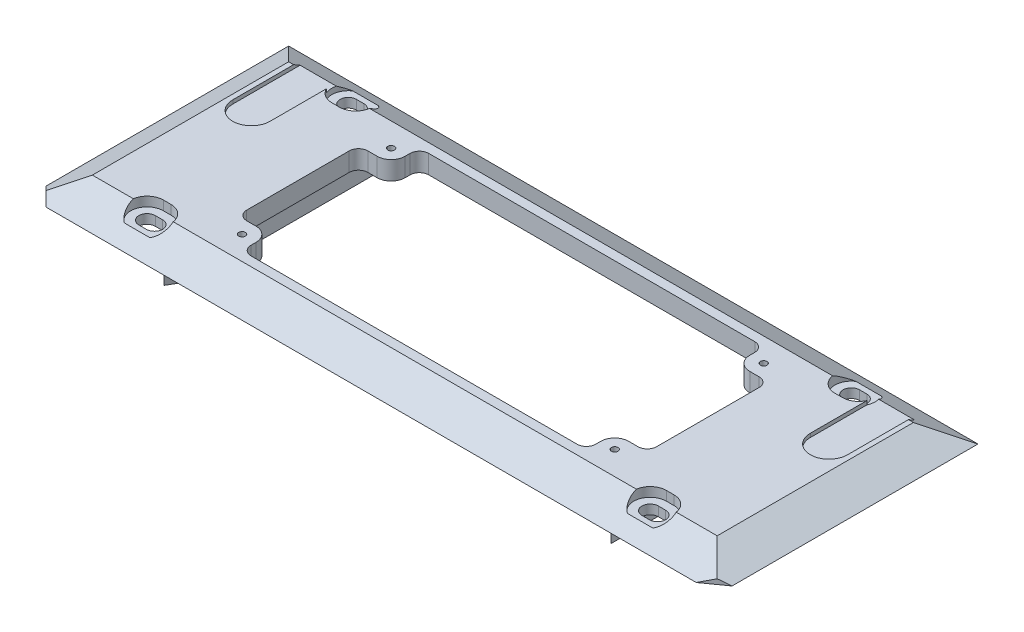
ISO-10303-21;
HEADER;
FILE_DESCRIPTION(('STEP AP214'),'2;1');
FILE_NAME('part.step','',(''),(''),'','','');
FILE_SCHEMA(('AUTOMOTIVE_DESIGN { 1 0 10303 214 1 1 1 1 }'));
ENDSEC;
DATA;
#1=APPLICATION_CONTEXT('core data for automotive mechanical design processes');
#2=APPLICATION_PROTOCOL_DEFINITION('international standard','automotive_design',2000,#1);
#3=PRODUCT_CONTEXT('',#1,'mechanical');
#4=PRODUCT('Part','Part','',(#3));
#5=PRODUCT_RELATED_PRODUCT_CATEGORY('part','',(#4));
#6=PRODUCT_DEFINITION_FORMATION('','',#4);
#7=PRODUCT_DEFINITION_CONTEXT('part definition',#1,'design');
#8=PRODUCT_DEFINITION('design','',#6,#7);
#9=PRODUCT_DEFINITION_SHAPE('','',#8);
#10=(LENGTH_UNIT() NAMED_UNIT(*) SI_UNIT(.MILLI.,.METRE.));
#11=(NAMED_UNIT(*) PLANE_ANGLE_UNIT() SI_UNIT($,.RADIAN.));
#12=(NAMED_UNIT(*) SI_UNIT($,.STERADIAN.) SOLID_ANGLE_UNIT());
#13=UNCERTAINTY_MEASURE_WITH_UNIT(LENGTH_MEASURE(1.E-05),#10,'distance_accuracy_value','');
#14=(GEOMETRIC_REPRESENTATION_CONTEXT(3) GLOBAL_UNCERTAINTY_ASSIGNED_CONTEXT((#13)) GLOBAL_UNIT_ASSIGNED_CONTEXT((#10,
#11,#12)) REPRESENTATION_CONTEXT('',''));
#15=CARTESIAN_POINT('',(0.,0.,0.));
#16=DIRECTION('',(0.,0.,1.));
#17=DIRECTION('',(1.,0.,0.));
#18=AXIS2_PLACEMENT_3D('',#15,#16,#17);
#19=CARTESIAN_POINT('',(0.,15.875,0.));
#20=DIRECTION('',(0.,1.,0.));
#21=DIRECTION('',(0.,0.,1.));
#22=AXIS2_PLACEMENT_3D('',#19,#20,#21);
#23=PLANE('',#22);
#24=DIRECTION('',(0.,0.,-1.));
#25=VECTOR('',#24,1.);
#26=CARTESIAN_POINT('',(104.775,15.875,-44.45));
#27=LINE('',#26,#25);
#28=CARTESIAN_POINT('',(104.775,15.875,-12.7));
#29=VERTEX_POINT('',#28);
#30=CARTESIAN_POINT('',(104.775,15.875,-33.4514773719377));
#31=VERTEX_POINT('',#30);
#32=EDGE_CURVE('E533',#29,#31,#27,.T.);
#33=ORIENTED_EDGE('',*,*,#32,.F.);
#34=CARTESIAN_POINT('',(98.425,15.875,-12.7));
#35=DIRECTION('',(0.,1.,0.));
#36=DIRECTION('',(0.,0.,1.));
#37=AXIS2_PLACEMENT_3D('',#34,#35,#36);
#38=CIRCLE('',#37,6.34999999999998);
#39=CARTESIAN_POINT('',(92.075,15.875,-12.7));
#40=VERTEX_POINT('',#39);
#41=EDGE_CURVE('E551',#40,#29,#38,.T.);
#42=ORIENTED_EDGE('',*,*,#41,.F.);
#43=DIRECTION('',(0.,0.,1.));
#44=VECTOR('',#43,1.);
#45=CARTESIAN_POINT('',(92.075,15.875,-44.45));
#46=LINE('',#45,#44);
#47=CARTESIAN_POINT('',(92.075,15.875,-31.9620515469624));
#48=VERTEX_POINT('',#47);
#49=EDGE_CURVE('E539',#48,#40,#46,.T.);
#50=ORIENTED_EDGE('',*,*,#49,.F.);
#51=CARTESIAN_POINT('',(86.995,15.875,-34.29));
#52=DIRECTION('',(0.,1.,0.));
#53=DIRECTION('',(0.,0.,1.));
#54=AXIS2_PLACEMENT_3D('',#51,#52,#53);
#55=CIRCLE('',#54,5.58799999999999);
#56=CARTESIAN_POINT('',(86.995,15.875,-28.702));
#57=VERTEX_POINT('',#56);
#58=EDGE_CURVE('E771',#57,#48,#55,.T.);
#59=ORIENTED_EDGE('',*,*,#58,.F.);
#60=DIRECTION('',(1.,0.,0.));
#61=VECTOR('',#60,1.);
#62=CARTESIAN_POINT('',(84.455,15.875,-28.702));
#63=LINE('',#62,#61);
#64=CARTESIAN_POINT('',(84.455,15.875,-28.702));
#65=VERTEX_POINT('',#64);
#66=EDGE_CURVE('E779',#65,#57,#63,.T.);
#67=ORIENTED_EDGE('',*,*,#66,.F.);
#68=CARTESIAN_POINT('',(84.455,15.875,-34.29));
#69=DIRECTION('',(0.,1.,0.));
#70=DIRECTION('',(0.,0.,1.));
#71=AXIS2_PLACEMENT_3D('',#68,#69,#70);
#72=CIRCLE('',#71,5.58799999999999);
#73=CARTESIAN_POINT('',(78.9302716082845,15.875,-33.4514773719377));
#74=VERTEX_POINT('',#73);
#75=EDGE_CURVE('E767',#74,#65,#72,.T.);
#76=ORIENTED_EDGE('',*,*,#75,.F.);
#77=DIRECTION('',(-1.,0.,0.));
#78=VECTOR('',#77,1.);
#79=CARTESIAN_POINT('',(0.,15.875,-33.4514773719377));
#80=LINE('',#79,#78);
#81=CARTESIAN_POINT('',(-78.9302716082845,15.875,-33.4514773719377));
#82=VERTEX_POINT('',#81);
#83=EDGE_CURVE('E975',#74,#82,#80,.T.);
#84=ORIENTED_EDGE('',*,*,#83,.T.);
#85=CARTESIAN_POINT('',(-84.455,15.875,-34.29));
#86=DIRECTION('',(0.,1.,0.));
#87=DIRECTION('',(0.,0.,1.));
#88=AXIS2_PLACEMENT_3D('',#85,#86,#87);
#89=CIRCLE('',#88,5.58799999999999);
#90=CARTESIAN_POINT('',(-84.455,15.875,-28.702));
#91=VERTEX_POINT('',#90);
#92=EDGE_CURVE('E801',#91,#82,#89,.T.);
#93=ORIENTED_EDGE('',*,*,#92,.F.);
#94=DIRECTION('',(1.,0.,0.));
#95=VECTOR('',#94,1.);
#96=CARTESIAN_POINT('',(-86.995,15.875,-28.702));
#97=LINE('',#96,#95);
#98=CARTESIAN_POINT('',(-86.995,15.875,-28.702));
#99=VERTEX_POINT('',#98);
#100=EDGE_CURVE('E808',#99,#91,#97,.T.);
#101=ORIENTED_EDGE('',*,*,#100,.F.);
#102=CARTESIAN_POINT('',(-86.995,15.875,-34.29));
#103=DIRECTION('',(0.,1.,0.));
#104=DIRECTION('',(0.,0.,1.));
#105=AXIS2_PLACEMENT_3D('',#102,#103,#104);
#106=CIRCLE('',#105,5.58799999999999);
#107=CARTESIAN_POINT('',(-92.075,15.875,-31.9620515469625));
#108=VERTEX_POINT('',#107);
#109=EDGE_CURVE('E797',#108,#99,#106,.T.);
#110=ORIENTED_EDGE('',*,*,#109,.F.);
#111=DIRECTION('',(0.,0.,-1.));
#112=VECTOR('',#111,1.);
#113=CARTESIAN_POINT('',(-92.075,15.875,-44.45));
#114=LINE('',#113,#112);
#115=CARTESIAN_POINT('',(-92.075,15.875,-12.7));
#116=VERTEX_POINT('',#115);
#117=EDGE_CURVE('E560',#116,#108,#114,.T.);
#118=ORIENTED_EDGE('',*,*,#117,.F.);
#119=CARTESIAN_POINT('',(-98.425,15.875,-12.7));
#120=DIRECTION('',(0.,1.,0.));
#121=DIRECTION('',(0.,0.,1.));
#122=AXIS2_PLACEMENT_3D('',#119,#120,#121);
#123=CIRCLE('',#122,6.34999999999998);
#124=CARTESIAN_POINT('',(-104.775,15.875,-12.7));
#125=VERTEX_POINT('',#124);
#126=EDGE_CURVE('E565',#125,#116,#123,.T.);
#127=ORIENTED_EDGE('',*,*,#126,.F.);
#128=DIRECTION('',(0.,0.,1.));
#129=VECTOR('',#128,1.);
#130=CARTESIAN_POINT('',(-104.775,15.875,-44.45));
#131=LINE('',#130,#129);
#132=CARTESIAN_POINT('',(-104.775,15.875,-33.4514773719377));
#133=VERTEX_POINT('',#132);
#134=EDGE_CURVE('E556',#133,#125,#131,.T.);
#135=ORIENTED_EDGE('',*,*,#134,.F.);
#136=CARTESIAN_POINT('',(-106.476477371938,15.875,-33.4514773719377));
#137=VERTEX_POINT('',#136);
#138=EDGE_CURVE('E969',#133,#137,#80,.T.);
#139=ORIENTED_EDGE('',*,*,#138,.T.);
#140=DIRECTION('',(0.,0.,1.));
#141=VECTOR('',#140,1.);
#142=CARTESIAN_POINT('',(-106.476477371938,15.875,0.));
#143=LINE('',#142,#141);
#144=CARTESIAN_POINT('',(-106.476477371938,15.875,33.4514773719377));
#145=VERTEX_POINT('',#144);
#146=EDGE_CURVE('E967',#137,#145,#143,.T.);
#147=ORIENTED_EDGE('',*,*,#146,.T.);
#148=DIRECTION('',(1.,0.,0.));
#149=VECTOR('',#148,1.);
#150=CARTESIAN_POINT('',(110.343607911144,15.875,33.4514773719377));
#151=LINE('',#150,#149);
#152=CARTESIAN_POINT('',(-92.5197283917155,15.875,33.4514773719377));
#153=VERTEX_POINT('',#152);
#154=EDGE_CURVE('E978',#145,#153,#151,.T.);
#155=ORIENTED_EDGE('',*,*,#154,.T.);
#156=CARTESIAN_POINT('',(-86.995,15.875,34.29));
#157=DIRECTION('',(0.,1.,0.));
#158=DIRECTION('',(0.,0.,1.));
#159=AXIS2_PLACEMENT_3D('',#156,#157,#158);
#160=CIRCLE('',#159,5.588);
#161=CARTESIAN_POINT('',(-86.995,15.875,28.702));
#162=VERTEX_POINT('',#161);
#163=EDGE_CURVE('E708',#162,#153,#160,.T.);
#164=ORIENTED_EDGE('',*,*,#163,.F.);
#165=DIRECTION('',(-1.,0.,0.));
#166=VECTOR('',#165,1.);
#167=CARTESIAN_POINT('',(-86.995,15.875,28.702));
#168=LINE('',#167,#166);
#169=CARTESIAN_POINT('',(-84.455,15.875,28.702));
#170=VERTEX_POINT('',#169);
#171=EDGE_CURVE('E714',#170,#162,#168,.T.);
#172=ORIENTED_EDGE('',*,*,#171,.F.);
#173=CARTESIAN_POINT('',(-84.455,15.875,34.29));
#174=DIRECTION('',(0.,1.,0.));
#175=DIRECTION('',(0.,0.,1.));
#176=AXIS2_PLACEMENT_3D('',#173,#174,#175);
#177=CIRCLE('',#176,5.588);
#178=CARTESIAN_POINT('',(-78.9302716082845,15.875,33.4514773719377));
#179=VERTEX_POINT('',#178);
#180=EDGE_CURVE('E721',#179,#170,#177,.T.);
#181=ORIENTED_EDGE('',*,*,#180,.F.);
#182=CARTESIAN_POINT('',(78.9302716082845,15.875,33.4514773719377));
#183=VERTEX_POINT('',#182);
#184=EDGE_CURVE('E982',#179,#183,#151,.T.);
#185=ORIENTED_EDGE('',*,*,#184,.T.);
#186=CARTESIAN_POINT('',(84.455,15.875,34.29));
#187=DIRECTION('',(0.,1.,0.));
#188=DIRECTION('',(0.,0.,1.));
#189=AXIS2_PLACEMENT_3D('',#186,#187,#188);
#190=CIRCLE('',#189,5.588);
#191=CARTESIAN_POINT('',(84.455,15.875,28.702));
#192=VERTEX_POINT('',#191);
#193=EDGE_CURVE('E738',#192,#183,#190,.T.);
#194=ORIENTED_EDGE('',*,*,#193,.F.);
#195=DIRECTION('',(-1.,0.,0.));
#196=VECTOR('',#195,1.);
#197=CARTESIAN_POINT('',(84.455,15.875,28.702));
#198=LINE('',#197,#196);
#199=CARTESIAN_POINT('',(86.995,15.875,28.702));
#200=VERTEX_POINT('',#199);
#201=EDGE_CURVE('E742',#200,#192,#198,.T.);
#202=ORIENTED_EDGE('',*,*,#201,.F.);
#203=CARTESIAN_POINT('',(86.995,15.875,34.29));
#204=DIRECTION('',(0.,1.,0.));
#205=DIRECTION('',(0.,0.,1.));
#206=AXIS2_PLACEMENT_3D('',#203,#204,#205);
#207=CIRCLE('',#206,5.588);
#208=CARTESIAN_POINT('',(92.5197283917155,15.875,33.4514773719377));
#209=VERTEX_POINT('',#208);
#210=EDGE_CURVE('E750',#209,#200,#207,.T.);
#211=ORIENTED_EDGE('',*,*,#210,.F.);
#212=CARTESIAN_POINT('',(106.476477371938,15.875,33.4514773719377));
#213=VERTEX_POINT('',#212);
#214=EDGE_CURVE('E977',#209,#213,#151,.T.);
#215=ORIENTED_EDGE('',*,*,#214,.T.);
#216=DIRECTION('',(0.,0.,-1.));
#217=VECTOR('',#216,1.);
#218=CARTESIAN_POINT('',(106.476477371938,15.875,-44.45));
#219=LINE('',#218,#217);
#220=CARTESIAN_POINT('',(106.476477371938,15.875,-33.4514773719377));
#221=VERTEX_POINT('',#220);
#222=EDGE_CURVE('E974',#213,#221,#219,.T.);
#223=ORIENTED_EDGE('',*,*,#222,.T.);
#224=EDGE_CURVE('E971',#221,#31,#80,.T.);
#225=ORIENTED_EDGE('',*,*,#224,.T.);
#226=EDGE_LOOP('',(#33,#42,#50,#59,#67,#76,#84,#93,#101,#110,#118,#127,#135,#139,#147,#155,#164,
#172,#181,#185,#194,#202,#211,#215,#223,#225));
#227=FACE_BOUND('',#226,.T.);
#228=CARTESIAN_POINT('',(-63.5,15.875,-25.4));
#229=DIRECTION('',(0.,-1.,0.));
#230=DIRECTION('',(0.,0.,-1.));
#231=AXIS2_PLACEMENT_3D('',#228,#229,#230);
#232=CIRCLE('',#231,1.1303);
#233=CARTESIAN_POINT('',(-63.5,15.875,-26.5303));
#234=VERTEX_POINT('',#233);
#235=EDGE_CURVE('E687',#234,#234,#232,.T.);
#236=ORIENTED_EDGE('',*,*,#235,.T.);
#237=EDGE_LOOP('',(#236));
#238=FACE_BOUND('',#237,.T.);
#239=CARTESIAN_POINT('',(63.5,15.875,-25.4));
#240=DIRECTION('',(0.,-1.,0.));
#241=DIRECTION('',(0.,0.,-1.));
#242=AXIS2_PLACEMENT_3D('',#239,#240,#241);
#243=CIRCLE('',#242,1.1303);
#244=CARTESIAN_POINT('',(63.5,15.875,-26.5303));
#245=VERTEX_POINT('',#244);
#246=EDGE_CURVE('E693',#245,#245,#243,.T.);
#247=ORIENTED_EDGE('',*,*,#246,.T.);
#248=EDGE_LOOP('',(#247));
#249=FACE_BOUND('',#248,.T.);
#250=CARTESIAN_POINT('',(63.5,15.875,25.4));
#251=DIRECTION('',(0.,-1.,0.));
#252=DIRECTION('',(0.,0.,-1.));
#253=AXIS2_PLACEMENT_3D('',#250,#251,#252);
#254=CIRCLE('',#253,1.1303);
#255=CARTESIAN_POINT('',(63.5,15.875,24.2697));
#256=VERTEX_POINT('',#255);
#257=EDGE_CURVE('E699',#256,#256,#254,.T.);
#258=ORIENTED_EDGE('',*,*,#257,.T.);
#259=EDGE_LOOP('',(#258));
#260=FACE_BOUND('',#259,.T.);
#261=CARTESIAN_POINT('',(-63.5,15.875,25.4));
#262=DIRECTION('',(0.,-1.,0.));
#263=DIRECTION('',(0.,0.,-1.));
#264=AXIS2_PLACEMENT_3D('',#261,#262,#263);
#265=CIRCLE('',#264,1.1303);
#266=CARTESIAN_POINT('',(-63.5,15.875,24.2697));
#267=VERTEX_POINT('',#266);
#268=EDGE_CURVE('E705',#267,#267,#265,.T.);
#269=ORIENTED_EDGE('',*,*,#268,.T.);
#270=EDGE_LOOP('',(#269));
#271=FACE_BOUND('',#270,.T.);
#272=DIRECTION('',(-1.,0.,0.));
#273=VECTOR('',#272,1.);
#274=CARTESIAN_POINT('',(0.,15.875,-20.6375));
#275=LINE('',#274,#273);
#276=CARTESIAN_POINT('',(-63.5,15.875,-20.6375));
#277=VERTEX_POINT('',#276);
#278=CARTESIAN_POINT('',(-66.6750000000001,15.875,-20.6375));
#279=VERTEX_POINT('',#278);
#280=EDGE_CURVE('E619',#277,#279,#275,.T.);
#281=ORIENTED_EDGE('',*,*,#280,.F.);
#282=CARTESIAN_POINT('',(-63.5,15.875,-25.4));
#283=DIRECTION('',(0.,-1.,0.));
#284=DIRECTION('',(0.,0.,-1.));
#285=AXIS2_PLACEMENT_3D('',#282,#283,#284);
#286=CIRCLE('',#285,4.7625);
#287=CARTESIAN_POINT('',(-58.7375,15.875,-25.4));
#288=VERTEX_POINT('',#287);
#289=EDGE_CURVE('E577',#288,#277,#286,.T.);
#290=ORIENTED_EDGE('',*,*,#289,.F.);
#291=DIRECTION('',(0.,0.,-1.));
#292=VECTOR('',#291,1.);
#293=CARTESIAN_POINT('',(-58.7375,15.875,0.));
#294=LINE('',#293,#292);
#295=CARTESIAN_POINT('',(-58.7375,15.875,-27.1014773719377));
#296=VERTEX_POINT('',#295);
#297=EDGE_CURVE('E579',#288,#296,#294,.T.);
#298=ORIENTED_EDGE('',*,*,#297,.T.);
#299=CARTESIAN_POINT('',(-55.5625,15.875,-27.1014773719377));
#300=DIRECTION('',(0.,1.,0.));
#301=DIRECTION('',(0.,0.,1.));
#302=AXIS2_PLACEMENT_3D('',#299,#300,#301);
#303=CIRCLE('',#302,3.175);
#304=CARTESIAN_POINT('',(-55.5625,15.875,-30.2764773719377));
#305=VERTEX_POINT('',#304);
#306=EDGE_CURVE('E1130',#296,#305,#303,.F.);
#307=ORIENTED_EDGE('',*,*,#306,.T.);
#308=DIRECTION('',(1.,0.,0.));
#309=VECTOR('',#308,1.);
#310=CARTESIAN_POINT('',(0.,15.875,-30.2764773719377));
#311=LINE('',#310,#309);
#312=CARTESIAN_POINT('',(55.5625,15.875,-30.2764773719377));
#313=VERTEX_POINT('',#312);
#314=EDGE_CURVE('E583',#305,#313,#311,.T.);
#315=ORIENTED_EDGE('',*,*,#314,.T.);
#316=CARTESIAN_POINT('',(55.5625,15.875,-27.1014773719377));
#317=DIRECTION('',(0.,1.,0.));
#318=DIRECTION('',(0.,0.,1.));
#319=AXIS2_PLACEMENT_3D('',#316,#317,#318);
#320=CIRCLE('',#319,3.175);
#321=CARTESIAN_POINT('',(58.7375,15.875,-27.1014773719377));
#322=VERTEX_POINT('',#321);
#323=EDGE_CURVE('E1110',#313,#322,#320,.F.);
#324=ORIENTED_EDGE('',*,*,#323,.T.);
#325=DIRECTION('',(0.,0.,-1.));
#326=VECTOR('',#325,1.);
#327=CARTESIAN_POINT('',(58.7375000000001,15.875,-1.67158893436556E-13));
#328=LINE('',#327,#326);
#329=CARTESIAN_POINT('',(58.7375,15.875,-25.4));
#330=VERTEX_POINT('',#329);
#331=EDGE_CURVE('E586',#330,#322,#328,.T.);
#332=ORIENTED_EDGE('',*,*,#331,.F.);
#333=CARTESIAN_POINT('',(63.5,15.875,-25.4));
#334=DIRECTION('',(0.,-1.,0.));
#335=DIRECTION('',(0.,0.,-1.));
#336=AXIS2_PLACEMENT_3D('',#333,#334,#335);
#337=CIRCLE('',#336,4.7625);
#338=CARTESIAN_POINT('',(63.5,15.875,-20.6375));
#339=VERTEX_POINT('',#338);
#340=EDGE_CURVE('E589',#339,#330,#337,.T.);
#341=ORIENTED_EDGE('',*,*,#340,.F.);
#342=DIRECTION('',(1.,0.,0.));
#343=VECTOR('',#342,1.);
#344=CARTESIAN_POINT('',(0.,15.875,-20.6375000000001));
#345=LINE('',#344,#343);
#346=CARTESIAN_POINT('',(66.6750000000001,15.875,-20.6375));
#347=VERTEX_POINT('',#346);
#348=EDGE_CURVE('E591',#339,#347,#345,.T.);
#349=ORIENTED_EDGE('',*,*,#348,.T.);
#350=CARTESIAN_POINT('',(66.6750000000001,15.875,-17.4625));
#351=DIRECTION('',(0.,1.,0.));
#352=DIRECTION('',(0.,0.,1.));
#353=AXIS2_PLACEMENT_3D('',#350,#351,#352);
#354=CIRCLE('',#353,3.175);
#355=CARTESIAN_POINT('',(69.8500000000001,15.875,-17.4625));
#356=VERTEX_POINT('',#355);
#357=EDGE_CURVE('E1114',#347,#356,#354,.F.);
#358=ORIENTED_EDGE('',*,*,#357,.T.);
#359=DIRECTION('',(0.,0.,-1.));
#360=VECTOR('',#359,1.);
#361=CARTESIAN_POINT('',(69.8500000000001,15.875,0.));
#362=LINE('',#361,#360);
#363=CARTESIAN_POINT('',(69.8500000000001,15.875,17.4625));
#364=VERTEX_POINT('',#363);
#365=EDGE_CURVE('E594',#364,#356,#362,.T.);
#366=ORIENTED_EDGE('',*,*,#365,.F.);
#367=CARTESIAN_POINT('',(66.6750000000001,15.875,17.4625));
#368=DIRECTION('',(0.,1.,0.));
#369=DIRECTION('',(0.,0.,1.));
#370=AXIS2_PLACEMENT_3D('',#367,#368,#369);
#371=CIRCLE('',#370,3.175);
#372=CARTESIAN_POINT('',(66.6750000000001,15.875,20.6375));
#373=VERTEX_POINT('',#372);
#374=EDGE_CURVE('E1118',#364,#373,#371,.F.);
#375=ORIENTED_EDGE('',*,*,#374,.T.);
#376=DIRECTION('',(1.,0.,0.));
#377=VECTOR('',#376,1.);
#378=CARTESIAN_POINT('',(0.,15.875,20.6375000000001));
#379=LINE('',#378,#377);
#380=CARTESIAN_POINT('',(63.5,15.875,20.6375));
#381=VERTEX_POINT('',#380);
#382=EDGE_CURVE('E597',#381,#373,#379,.T.);
#383=ORIENTED_EDGE('',*,*,#382,.F.);
#384=CARTESIAN_POINT('',(63.5,15.875,25.4));
#385=DIRECTION('',(0.,-1.,0.));
#386=DIRECTION('',(0.,0.,-1.));
#387=AXIS2_PLACEMENT_3D('',#384,#385,#386);
#388=CIRCLE('',#387,4.7625);
#389=CARTESIAN_POINT('',(58.7375,15.875,25.4));
#390=VERTEX_POINT('',#389);
#391=EDGE_CURVE('E600',#390,#381,#388,.T.);
#392=ORIENTED_EDGE('',*,*,#391,.F.);
#393=DIRECTION('',(0.,0.,1.));
#394=VECTOR('',#393,1.);
#395=CARTESIAN_POINT('',(58.7375000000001,15.875,2.50738340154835E-13));
#396=LINE('',#395,#394);
#397=CARTESIAN_POINT('',(58.7375,15.875,27.1014773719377));
#398=VERTEX_POINT('',#397);
#399=EDGE_CURVE('E602',#390,#398,#396,.T.);
#400=ORIENTED_EDGE('',*,*,#399,.T.);
#401=CARTESIAN_POINT('',(55.5625,15.875,27.1014773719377));
#402=DIRECTION('',(0.,1.,0.));
#403=DIRECTION('',(0.,0.,1.));
#404=AXIS2_PLACEMENT_3D('',#401,#402,#403);
#405=CIRCLE('',#404,3.175);
#406=CARTESIAN_POINT('',(55.5625,15.875,30.2764773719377));
#407=VERTEX_POINT('',#406);
#408=EDGE_CURVE('E1122',#398,#407,#405,.F.);
#409=ORIENTED_EDGE('',*,*,#408,.T.);
#410=DIRECTION('',(1.,0.,0.));
#411=VECTOR('',#410,1.);
#412=CARTESIAN_POINT('',(0.,15.875,30.2764773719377));
#413=LINE('',#412,#411);
#414=CARTESIAN_POINT('',(-55.5625,15.875,30.2764773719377));
#415=VERTEX_POINT('',#414);
#416=EDGE_CURVE('E605',#415,#407,#413,.T.);
#417=ORIENTED_EDGE('',*,*,#416,.F.);
#418=CARTESIAN_POINT('',(-55.5625,15.875,27.1014773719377));
#419=DIRECTION('',(0.,1.,0.));
#420=DIRECTION('',(0.,0.,1.));
#421=AXIS2_PLACEMENT_3D('',#418,#419,#420);
#422=CIRCLE('',#421,3.175);
#423=CARTESIAN_POINT('',(-58.7375,15.875,27.1014773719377));
#424=VERTEX_POINT('',#423);
#425=EDGE_CURVE('E1138',#415,#424,#422,.F.);
#426=ORIENTED_EDGE('',*,*,#425,.T.);
#427=DIRECTION('',(0.,0.,1.));
#428=VECTOR('',#427,1.);
#429=CARTESIAN_POINT('',(-58.7375,15.875,0.));
#430=LINE('',#429,#428);
#431=CARTESIAN_POINT('',(-58.7375,15.875,25.4));
#432=VERTEX_POINT('',#431);
#433=EDGE_CURVE('E608',#432,#424,#430,.T.);
#434=ORIENTED_EDGE('',*,*,#433,.F.);
#435=CARTESIAN_POINT('',(-63.5,15.875,25.4));
#436=DIRECTION('',(0.,-1.,0.));
#437=DIRECTION('',(0.,0.,-1.));
#438=AXIS2_PLACEMENT_3D('',#435,#436,#437);
#439=CIRCLE('',#438,4.7625);
#440=CARTESIAN_POINT('',(-63.5,15.875,20.6375));
#441=VERTEX_POINT('',#440);
#442=EDGE_CURVE('E611',#441,#432,#439,.T.);
#443=ORIENTED_EDGE('',*,*,#442,.F.);
#444=DIRECTION('',(-1.,0.,0.));
#445=VECTOR('',#444,1.);
#446=CARTESIAN_POINT('',(0.,15.875,20.6375));
#447=LINE('',#446,#445);
#448=CARTESIAN_POINT('',(-66.6750000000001,15.875,20.6375));
#449=VERTEX_POINT('',#448);
#450=EDGE_CURVE('E613',#441,#449,#447,.T.);
#451=ORIENTED_EDGE('',*,*,#450,.T.);
#452=CARTESIAN_POINT('',(-66.6750000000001,15.875,17.4625));
#453=DIRECTION('',(0.,1.,0.));
#454=DIRECTION('',(0.,0.,1.));
#455=AXIS2_PLACEMENT_3D('',#452,#453,#454);
#456=CIRCLE('',#455,3.175);
#457=CARTESIAN_POINT('',(-69.8500000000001,15.875,17.4625));
#458=VERTEX_POINT('',#457);
#459=EDGE_CURVE('E1134',#449,#458,#456,.F.);
#460=ORIENTED_EDGE('',*,*,#459,.T.);
#461=DIRECTION('',(0.,0.,-1.));
#462=VECTOR('',#461,1.);
#463=CARTESIAN_POINT('',(-69.8500000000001,15.875,0.));
#464=LINE('',#463,#462);
#465=CARTESIAN_POINT('',(-69.8500000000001,15.875,-17.4625));
#466=VERTEX_POINT('',#465);
#467=EDGE_CURVE('E616',#458,#466,#464,.T.);
#468=ORIENTED_EDGE('',*,*,#467,.T.);
#469=CARTESIAN_POINT('',(-66.6750000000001,15.875,-17.4625));
#470=DIRECTION('',(0.,1.,0.));
#471=DIRECTION('',(0.,0.,1.));
#472=AXIS2_PLACEMENT_3D('',#469,#470,#471);
#473=CIRCLE('',#472,3.175);
#474=EDGE_CURVE('E1126',#466,#279,#473,.F.);
#475=ORIENTED_EDGE('',*,*,#474,.T.);
#476=EDGE_LOOP('',(#281,#290,#298,#307,#315,#324,#332,#341,#349,#358,#366,#375,#383,#392,#400,
#409,#417,#426,#434,#443,#451,#460,#468,#475));
#477=FACE_BOUND('',#476,.T.);
#478=ADVANCED_FACE('F39',(#227,#238,#249,#260,#271,#477),#23,.T.);
#479=CARTESIAN_POINT('',(0.,9.525,-44.45));
#480=DIRECTION('',(0.,-1.,0.));
#481=DIRECTION('',(0.,0.,-1.));
#482=AXIS2_PLACEMENT_3D('',#479,#480,#481);
#483=PLANE('',#482);
#484=CARTESIAN_POINT('',(-63.5,9.525,-25.4));
#485=DIRECTION('',(0.,-1.,0.));
#486=DIRECTION('',(0.,0.,-1.));
#487=AXIS2_PLACEMENT_3D('',#484,#485,#486);
#488=CIRCLE('',#487,1.1303);
#489=CARTESIAN_POINT('',(-63.5,9.525,-26.5303));
#490=VERTEX_POINT('',#489);
#491=EDGE_CURVE('E672',#490,#490,#488,.T.);
#492=ORIENTED_EDGE('',*,*,#491,.F.);
#493=EDGE_LOOP('',(#492));
#494=FACE_BOUND('',#493,.T.);
#495=CARTESIAN_POINT('',(63.5,9.525,-25.4));
#496=DIRECTION('',(0.,-1.,0.));
#497=DIRECTION('',(0.,0.,-1.));
#498=AXIS2_PLACEMENT_3D('',#495,#496,#497);
#499=CIRCLE('',#498,1.1303);
#500=CARTESIAN_POINT('',(63.5,9.525,-26.5303));
#501=VERTEX_POINT('',#500);
#502=EDGE_CURVE('E690',#501,#501,#499,.T.);
#503=ORIENTED_EDGE('',*,*,#502,.F.);
#504=EDGE_LOOP('',(#503));
#505=FACE_BOUND('',#504,.T.);
#506=CARTESIAN_POINT('',(63.5,9.525,25.4));
#507=DIRECTION('',(0.,-1.,0.));
#508=DIRECTION('',(0.,0.,-1.));
#509=AXIS2_PLACEMENT_3D('',#506,#507,#508);
#510=CIRCLE('',#509,1.1303);
#511=CARTESIAN_POINT('',(63.5,9.525,24.2697));
#512=VERTEX_POINT('',#511);
#513=EDGE_CURVE('E696',#512,#512,#510,.T.);
#514=ORIENTED_EDGE('',*,*,#513,.F.);
#515=EDGE_LOOP('',(#514));
#516=FACE_BOUND('',#515,.T.);
#517=CARTESIAN_POINT('',(-63.5,9.525,25.4));
#518=DIRECTION('',(0.,-1.,0.));
#519=DIRECTION('',(0.,0.,-1.));
#520=AXIS2_PLACEMENT_3D('',#517,#518,#519);
#521=CIRCLE('',#520,1.1303);
#522=CARTESIAN_POINT('',(-63.5,9.525,24.2697));
#523=VERTEX_POINT('',#522);
#524=EDGE_CURVE('E702',#523,#523,#521,.T.);
#525=ORIENTED_EDGE('',*,*,#524,.F.);
#526=EDGE_LOOP('',(#525));
#527=FACE_BOUND('',#526,.T.);
#528=CARTESIAN_POINT('',(84.455,9.525,-34.29));
#529=DIRECTION('',(0.,-1.,0.));
#530=DIRECTION('',(1.,0.,0.));
#531=AXIS2_PLACEMENT_3D('',#528,#529,#530);
#532=CIRCLE('',#531,2.79399999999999);
#533=CARTESIAN_POINT('',(84.455,9.525,-31.496));
#534=VERTEX_POINT('',#533);
#535=CARTESIAN_POINT('',(84.455,9.525,-37.084));
#536=VERTEX_POINT('',#535);
#537=EDGE_CURVE('E826',#534,#536,#532,.T.);
#538=ORIENTED_EDGE('',*,*,#537,.F.);
#539=DIRECTION('',(-1.,0.,0.));
#540=VECTOR('',#539,1.);
#541=CARTESIAN_POINT('',(84.455,9.525,-31.496));
#542=LINE('',#541,#540);
#543=CARTESIAN_POINT('',(86.995,9.525,-31.496));
#544=VERTEX_POINT('',#543);
#545=EDGE_CURVE('E835',#544,#534,#542,.T.);
#546=ORIENTED_EDGE('',*,*,#545,.F.);
#547=CARTESIAN_POINT('',(86.995,9.525,-34.29));
#548=DIRECTION('',(0.,-1.,0.));
#549=DIRECTION('',(1.,0.,0.));
#550=AXIS2_PLACEMENT_3D('',#547,#548,#549);
#551=CIRCLE('',#550,2.79399999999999);
#552=CARTESIAN_POINT('',(86.995,9.525,-37.084));
#553=VERTEX_POINT('',#552);
#554=EDGE_CURVE('E832',#553,#544,#551,.T.);
#555=ORIENTED_EDGE('',*,*,#554,.F.);
#556=DIRECTION('',(1.,0.,0.));
#557=VECTOR('',#556,1.);
#558=CARTESIAN_POINT('',(84.455,9.525,-37.084));
#559=LINE('',#558,#557);
#560=EDGE_CURVE('E829',#536,#553,#559,.T.);
#561=ORIENTED_EDGE('',*,*,#560,.F.);
#562=EDGE_LOOP('',(#538,#546,#555,#561));
#563=FACE_BOUND('',#562,.T.);
#564=CARTESIAN_POINT('',(84.455,9.525,34.29));
#565=DIRECTION('',(0.,-1.,0.));
#566=DIRECTION('',(1.,0.,0.));
#567=AXIS2_PLACEMENT_3D('',#564,#565,#566);
#568=CIRCLE('',#567,2.79399999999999);
#569=CARTESIAN_POINT('',(84.455,9.525,37.084));
#570=VERTEX_POINT('',#569);
#571=CARTESIAN_POINT('',(84.455,9.525,31.496));
#572=VERTEX_POINT('',#571);
#573=EDGE_CURVE('E841',#570,#572,#568,.T.);
#574=ORIENTED_EDGE('',*,*,#573,.F.);
#575=DIRECTION('',(-1.,0.,0.));
#576=VECTOR('',#575,1.);
#577=CARTESIAN_POINT('',(84.455,9.525,37.084));
#578=LINE('',#577,#576);
#579=CARTESIAN_POINT('',(86.995,9.525,37.084));
#580=VERTEX_POINT('',#579);
#581=EDGE_CURVE('E855',#580,#570,#578,.T.);
#582=ORIENTED_EDGE('',*,*,#581,.F.);
#583=CARTESIAN_POINT('',(86.995,9.525,34.29));
#584=DIRECTION('',(0.,-1.,0.));
#585=DIRECTION('',(1.,0.,0.));
#586=AXIS2_PLACEMENT_3D('',#583,#584,#585);
#587=CIRCLE('',#586,2.79399999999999);
#588=CARTESIAN_POINT('',(86.995,9.525,31.496));
#589=VERTEX_POINT('',#588);
#590=EDGE_CURVE('E852',#589,#580,#587,.T.);
#591=ORIENTED_EDGE('',*,*,#590,.F.);
#592=DIRECTION('',(1.,0.,0.));
#593=VECTOR('',#592,1.);
#594=CARTESIAN_POINT('',(84.455,9.525,31.496));
#595=LINE('',#594,#593);
#596=EDGE_CURVE('E849',#572,#589,#595,.T.);
#597=ORIENTED_EDGE('',*,*,#596,.F.);
#598=EDGE_LOOP('',(#574,#582,#591,#597));
#599=FACE_BOUND('',#598,.T.);
#600=CARTESIAN_POINT('',(-84.455,9.525,34.29));
#601=DIRECTION('',(0.,-1.,0.));
#602=DIRECTION('',(1.,0.,0.));
#603=AXIS2_PLACEMENT_3D('',#600,#601,#602);
#604=CIRCLE('',#603,2.794);
#605=CARTESIAN_POINT('',(-84.455,9.525,31.496));
#606=VERTEX_POINT('',#605);
#607=CARTESIAN_POINT('',(-84.455,9.525,37.084));
#608=VERTEX_POINT('',#607);
#609=EDGE_CURVE('E861',#606,#608,#604,.T.);
#610=ORIENTED_EDGE('',*,*,#609,.F.);
#611=DIRECTION('',(1.,0.,0.));
#612=VECTOR('',#611,1.);
#613=CARTESIAN_POINT('',(-84.455,9.525,31.496));
#614=LINE('',#613,#612);
#615=CARTESIAN_POINT('',(-86.995,9.525,31.496));
#616=VERTEX_POINT('',#615);
#617=EDGE_CURVE('E875',#616,#606,#614,.T.);
#618=ORIENTED_EDGE('',*,*,#617,.F.);
#619=CARTESIAN_POINT('',(-86.995,9.525,34.29));
#620=DIRECTION('',(0.,-1.,0.));
#621=DIRECTION('',(1.,0.,0.));
#622=AXIS2_PLACEMENT_3D('',#619,#620,#621);
#623=CIRCLE('',#622,2.794);
#624=CARTESIAN_POINT('',(-86.995,9.525,37.084));
#625=VERTEX_POINT('',#624);
#626=EDGE_CURVE('E872',#625,#616,#623,.T.);
#627=ORIENTED_EDGE('',*,*,#626,.F.);
#628=DIRECTION('',(-1.,0.,0.));
#629=VECTOR('',#628,1.);
#630=CARTESIAN_POINT('',(-84.455,9.525,37.084));
#631=LINE('',#630,#629);
#632=EDGE_CURVE('E869',#608,#625,#631,.T.);
#633=ORIENTED_EDGE('',*,*,#632,.F.);
#634=EDGE_LOOP('',(#610,#618,#627,#633));
#635=FACE_BOUND('',#634,.T.);
#636=CARTESIAN_POINT('',(-84.455,9.525,-34.29));
#637=DIRECTION('',(0.,-1.,0.));
#638=DIRECTION('',(1.,0.,0.));
#639=AXIS2_PLACEMENT_3D('',#636,#637,#638);
#640=CIRCLE('',#639,2.794);
#641=CARTESIAN_POINT('',(-84.455,9.525,-37.084));
#642=VERTEX_POINT('',#641);
#643=CARTESIAN_POINT('',(-84.455,9.525,-31.496));
#644=VERTEX_POINT('',#643);
#645=EDGE_CURVE('E881',#642,#644,#640,.T.);
#646=ORIENTED_EDGE('',*,*,#645,.F.);
#647=DIRECTION('',(1.,0.,0.));
#648=VECTOR('',#647,1.);
#649=CARTESIAN_POINT('',(-84.455,9.525,-37.084));
#650=LINE('',#649,#648);
#651=CARTESIAN_POINT('',(-86.995,9.525,-37.084));
#652=VERTEX_POINT('',#651);
#653=EDGE_CURVE('E895',#652,#642,#650,.T.);
#654=ORIENTED_EDGE('',*,*,#653,.F.);
#655=CARTESIAN_POINT('',(-86.995,9.525,-34.29));
#656=DIRECTION('',(0.,-1.,0.));
#657=DIRECTION('',(1.,0.,0.));
#658=AXIS2_PLACEMENT_3D('',#655,#656,#657);
#659=CIRCLE('',#658,2.794);
#660=CARTESIAN_POINT('',(-86.995,9.525,-31.496));
#661=VERTEX_POINT('',#660);
#662=EDGE_CURVE('E892',#661,#652,#659,.T.);
#663=ORIENTED_EDGE('',*,*,#662,.F.);
#664=DIRECTION('',(-1.,0.,0.));
#665=VECTOR('',#664,1.);
#666=CARTESIAN_POINT('',(-84.455,9.525,-31.496));
#667=LINE('',#666,#665);
#668=EDGE_CURVE('E889',#644,#661,#667,.T.);
#669=ORIENTED_EDGE('',*,*,#668,.F.);
#670=EDGE_LOOP('',(#646,#654,#663,#669));
#671=FACE_BOUND('',#670,.T.);
#672=DIRECTION('',(0.,0.,1.));
#673=VECTOR('',#672,1.);
#674=CARTESIAN_POINT('',(-76.2,9.525,-44.45));
#675=LINE('',#674,#673);
#676=CARTESIAN_POINT('',(-76.2,9.525,-39.37));
#677=VERTEX_POINT('',#676);
#678=CARTESIAN_POINT('',(-76.2,9.525,39.37));
#679=VERTEX_POINT('',#678);
#680=EDGE_CURVE('E938',#677,#679,#675,.T.);
#681=ORIENTED_EDGE('',*,*,#680,.T.);
#682=DIRECTION('',(0.500000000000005,0.,-0.866025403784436));
#683=VECTOR('',#682,1.);
#684=CARTESIAN_POINT('',(-76.2000000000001,9.525,39.37));
#685=LINE('',#684,#683);
#686=CARTESIAN_POINT('',(-73.025,9.525,33.8707386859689));
#687=VERTEX_POINT('',#686);
#688=EDGE_CURVE('E1034',#679,#687,#685,.T.);
#689=ORIENTED_EDGE('',*,*,#688,.T.);
#690=DIRECTION('',(0.,0.,1.));
#691=VECTOR('',#690,1.);
#692=CARTESIAN_POINT('',(-73.025,9.525,-44.45));
#693=LINE('',#692,#691);
#694=CARTESIAN_POINT('',(-73.025,9.525,-33.8707386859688));
#695=VERTEX_POINT('',#694);
#696=EDGE_CURVE('E948',#695,#687,#693,.T.);
#697=ORIENTED_EDGE('',*,*,#696,.F.);
#698=DIRECTION('',(-0.500000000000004,0.,-0.866025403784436));
#699=VECTOR('',#698,1.);
#700=CARTESIAN_POINT('',(-76.2000000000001,9.525,-39.37));
#701=LINE('',#700,#699);
#702=EDGE_CURVE('E1032',#695,#677,#701,.T.);
#703=ORIENTED_EDGE('',*,*,#702,.T.);
#704=EDGE_LOOP('',(#681,#689,#697,#703));
#705=FACE_BOUND('',#704,.T.);
#706=DIRECTION('',(-0.707106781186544,0.,-0.707106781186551));
#707=VECTOR('',#706,1.);
#708=CARTESIAN_POINT('',(-77.8668750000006,9.525,77.8668749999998));
#709=LINE('',#708,#707);
#710=CARTESIAN_POINT('',(-111.28375,9.525,44.45));
#711=VERTEX_POINT('',#710);
#712=CARTESIAN_POINT('',(-117.475,9.525,38.2587499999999));
#713=VERTEX_POINT('',#712);
#714=EDGE_CURVE('E964',#711,#713,#709,.T.);
#715=ORIENTED_EDGE('',*,*,#714,.T.);
#716=DIRECTION('',(0.,0.,-1.));
#717=VECTOR('',#716,1.);
#718=CARTESIAN_POINT('',(-117.475,9.52499999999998,0.));
#719=LINE('',#718,#717);
#720=CARTESIAN_POINT('',(-117.475,9.525,-44.45));
#721=VERTEX_POINT('',#720);
#722=EDGE_CURVE('E998',#713,#721,#719,.T.);
#723=ORIENTED_EDGE('',*,*,#722,.T.);
#724=DIRECTION('',(1.,0.,0.));
#725=VECTOR('',#724,1.);
#726=CARTESIAN_POINT('',(0.,9.52499999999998,-44.45));
#727=LINE('',#726,#725);
#728=CARTESIAN_POINT('',(117.475,9.525,-44.45));
#729=VERTEX_POINT('',#728);
#730=EDGE_CURVE('E996',#721,#729,#727,.T.);
#731=ORIENTED_EDGE('',*,*,#730,.T.);
#732=DIRECTION('',(0.,0.,1.));
#733=VECTOR('',#732,1.);
#734=CARTESIAN_POINT('',(117.475,9.52499999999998,39.37));
#735=LINE('',#734,#733);
#736=CARTESIAN_POINT('',(117.475,9.525,39.37));
#737=VERTEX_POINT('',#736);
#738=EDGE_CURVE('E994',#729,#737,#735,.T.);
#739=ORIENTED_EDGE('',*,*,#738,.T.);
#740=DIRECTION('',(0.814481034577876,0.,-0.580190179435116));
#741=VECTOR('',#740,1.);
#742=CARTESIAN_POINT('',(58.1489571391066,9.525,81.6305143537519));
#743=LINE('',#742,#741);
#744=CARTESIAN_POINT('',(110.343607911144,9.52499999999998,44.45));
#745=VERTEX_POINT('',#744);
#746=EDGE_CURVE('E941',#745,#737,#743,.T.);
#747=ORIENTED_EDGE('',*,*,#746,.F.);
#748=DIRECTION('',(-1.,0.,0.));
#749=VECTOR('',#748,1.);
#750=CARTESIAN_POINT('',(-111.28375,9.52499999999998,44.45));
#751=LINE('',#750,#749);
#752=EDGE_CURVE('E987',#745,#711,#751,.T.);
#753=ORIENTED_EDGE('',*,*,#752,.T.);
#754=EDGE_LOOP('',(#715,#723,#731,#739,#747,#753));
#755=FACE_BOUND('',#754,.T.);
#756=DIRECTION('',(0.,0.,1.));
#757=VECTOR('',#756,1.);
#758=CARTESIAN_POINT('',(76.2,9.525,-44.45));
#759=LINE('',#758,#757);
#760=CARTESIAN_POINT('',(76.2,9.525,-39.37));
#761=VERTEX_POINT('',#760);
#762=CARTESIAN_POINT('',(76.2,9.525,39.37));
#763=VERTEX_POINT('',#762);
#764=EDGE_CURVE('E937',#761,#763,#759,.T.);
#765=ORIENTED_EDGE('',*,*,#764,.F.);
#766=DIRECTION('',(0.499999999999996,0.,-0.866025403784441));
#767=VECTOR('',#766,1.);
#768=CARTESIAN_POINT('',(73.025,9.525,-33.8707386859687));
#769=LINE('',#768,#767);
#770=CARTESIAN_POINT('',(73.025,9.525,-33.8707386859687));
#771=VERTEX_POINT('',#770);
#772=EDGE_CURVE('E1030',#761,#771,#769,.F.);
#773=ORIENTED_EDGE('',*,*,#772,.T.);
#774=DIRECTION('',(0.,0.,1.));
#775=VECTOR('',#774,1.);
#776=CARTESIAN_POINT('',(73.025,9.525,-44.45));
#777=LINE('',#776,#775);
#778=CARTESIAN_POINT('',(73.025,9.525,33.8707386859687));
#779=VERTEX_POINT('',#778);
#780=EDGE_CURVE('E951',#771,#779,#777,.T.);
#781=ORIENTED_EDGE('',*,*,#780,.T.);
#782=DIRECTION('',(-0.499999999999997,0.,-0.86602540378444));
#783=VECTOR('',#782,1.);
#784=CARTESIAN_POINT('',(73.025,9.525,33.8707386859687));
#785=LINE('',#784,#783);
#786=EDGE_CURVE('E1028',#779,#763,#785,.F.);
#787=ORIENTED_EDGE('',*,*,#786,.T.);
#788=EDGE_LOOP('',(#765,#773,#781,#787));
#789=FACE_BOUND('',#788,.T.);
#790=DIRECTION('',(0.,0.,-1.));
#791=VECTOR('',#790,1.);
#792=CARTESIAN_POINT('',(-58.7375,9.525,0.));
#793=LINE('',#792,#791);
#794=CARTESIAN_POINT('',(-58.7375,9.525,-25.4));
#795=VERTEX_POINT('',#794);
#796=CARTESIAN_POINT('',(-58.7375,9.525,-27.1014773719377));
#797=VERTEX_POINT('',#796);
#798=EDGE_CURVE('E625',#795,#797,#793,.T.);
#799=ORIENTED_EDGE('',*,*,#798,.F.);
#800=CARTESIAN_POINT('',(-63.5,9.525,-25.4));
#801=DIRECTION('',(0.,-1.,0.));
#802=DIRECTION('',(0.,0.,-1.));
#803=AXIS2_PLACEMENT_3D('',#800,#801,#802);
#804=CIRCLE('',#803,4.7625);
#805=CARTESIAN_POINT('',(-63.5,9.525,-20.6375));
#806=VERTEX_POINT('',#805);
#807=EDGE_CURVE('E576',#795,#806,#804,.T.);
#808=ORIENTED_EDGE('',*,*,#807,.T.);
#809=DIRECTION('',(-1.,0.,0.));
#810=VECTOR('',#809,1.);
#811=CARTESIAN_POINT('',(0.,9.525,-20.6375));
#812=LINE('',#811,#810);
#813=CARTESIAN_POINT('',(-66.6750000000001,9.525,-20.6375));
#814=VERTEX_POINT('',#813);
#815=EDGE_CURVE('E580',#806,#814,#812,.T.);
#816=ORIENTED_EDGE('',*,*,#815,.T.);
#817=CARTESIAN_POINT('',(-66.6750000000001,9.525,-17.4625));
#818=DIRECTION('',(0.,-1.,0.));
#819=DIRECTION('',(0.,0.,-1.));
#820=AXIS2_PLACEMENT_3D('',#817,#818,#819);
#821=CIRCLE('',#820,3.175);
#822=CARTESIAN_POINT('',(-69.8500000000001,9.525,-17.4625));
#823=VERTEX_POINT('',#822);
#824=EDGE_CURVE('E1124',#814,#823,#821,.F.);
#825=ORIENTED_EDGE('',*,*,#824,.T.);
#826=DIRECTION('',(0.,0.,-1.));
#827=VECTOR('',#826,1.);
#828=CARTESIAN_POINT('',(-69.8500000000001,9.525,0.));
#829=LINE('',#828,#827);
#830=CARTESIAN_POINT('',(-69.8500000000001,9.525,17.4625));
#831=VERTEX_POINT('',#830);
#832=EDGE_CURVE('E664',#831,#823,#829,.T.);
#833=ORIENTED_EDGE('',*,*,#832,.F.);
#834=CARTESIAN_POINT('',(-66.6750000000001,9.525,17.4625));
#835=DIRECTION('',(0.,-1.,0.));
#836=DIRECTION('',(0.,0.,-1.));
#837=AXIS2_PLACEMENT_3D('',#834,#835,#836);
#838=CIRCLE('',#837,3.175);
#839=CARTESIAN_POINT('',(-66.6750000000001,9.525,20.6375));
#840=VERTEX_POINT('',#839);
#841=EDGE_CURVE('E1132',#831,#840,#838,.F.);
#842=ORIENTED_EDGE('',*,*,#841,.T.);
#843=DIRECTION('',(-1.,0.,0.));
#844=VECTOR('',#843,1.);
#845=CARTESIAN_POINT('',(0.,9.525,20.6375));
#846=LINE('',#845,#844);
#847=CARTESIAN_POINT('',(-63.5,9.525,20.6375));
#848=VERTEX_POINT('',#847);
#849=EDGE_CURVE('E661',#848,#840,#846,.T.);
#850=ORIENTED_EDGE('',*,*,#849,.F.);
#851=CARTESIAN_POINT('',(-63.5,9.525,25.4));
#852=DIRECTION('',(0.,-1.,0.));
#853=DIRECTION('',(0.,0.,-1.));
#854=AXIS2_PLACEMENT_3D('',#851,#852,#853);
#855=CIRCLE('',#854,4.7625);
#856=CARTESIAN_POINT('',(-58.7375,9.525,25.4));
#857=VERTEX_POINT('',#856);
#858=EDGE_CURVE('E658',#848,#857,#855,.T.);
#859=ORIENTED_EDGE('',*,*,#858,.T.);
#860=DIRECTION('',(0.,0.,1.));
#861=VECTOR('',#860,1.);
#862=CARTESIAN_POINT('',(-58.7375,9.525,0.));
#863=LINE('',#862,#861);
#864=CARTESIAN_POINT('',(-58.7375,9.525,27.1014773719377));
#865=VERTEX_POINT('',#864);
#866=EDGE_CURVE('E655',#857,#865,#863,.T.);
#867=ORIENTED_EDGE('',*,*,#866,.T.);
#868=CARTESIAN_POINT('',(-55.5625,9.525,27.1014773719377));
#869=DIRECTION('',(0.,-1.,0.));
#870=DIRECTION('',(0.,0.,-1.));
#871=AXIS2_PLACEMENT_3D('',#868,#869,#870);
#872=CIRCLE('',#871,3.175);
#873=CARTESIAN_POINT('',(-55.5625,9.525,30.2764773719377));
#874=VERTEX_POINT('',#873);
#875=EDGE_CURVE('E1136',#865,#874,#872,.F.);
#876=ORIENTED_EDGE('',*,*,#875,.T.);
#877=DIRECTION('',(1.,0.,0.));
#878=VECTOR('',#877,1.);
#879=CARTESIAN_POINT('',(0.,9.525,30.2764773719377));
#880=LINE('',#879,#878);
#881=CARTESIAN_POINT('',(55.5625,9.525,30.2764773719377));
#882=VERTEX_POINT('',#881);
#883=EDGE_CURVE('E652',#874,#882,#880,.T.);
#884=ORIENTED_EDGE('',*,*,#883,.T.);
#885=CARTESIAN_POINT('',(55.5625,9.525,27.1014773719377));
#886=DIRECTION('',(0.,-1.,0.));
#887=DIRECTION('',(0.,0.,-1.));
#888=AXIS2_PLACEMENT_3D('',#885,#886,#887);
#889=CIRCLE('',#888,3.175);
#890=CARTESIAN_POINT('',(58.7375,9.525,27.1014773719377));
#891=VERTEX_POINT('',#890);
#892=EDGE_CURVE('E1120',#882,#891,#889,.F.);
#893=ORIENTED_EDGE('',*,*,#892,.T.);
#894=DIRECTION('',(0.,0.,1.));
#895=VECTOR('',#894,1.);
#896=CARTESIAN_POINT('',(58.7375000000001,9.525,2.50738340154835E-13));
#897=LINE('',#896,#895);
#898=CARTESIAN_POINT('',(58.7375,9.525,25.4));
#899=VERTEX_POINT('',#898);
#900=EDGE_CURVE('E649',#899,#891,#897,.T.);
#901=ORIENTED_EDGE('',*,*,#900,.F.);
#902=CARTESIAN_POINT('',(63.5,9.525,25.4));
#903=DIRECTION('',(0.,-1.,0.));
#904=DIRECTION('',(0.,0.,-1.));
#905=AXIS2_PLACEMENT_3D('',#902,#903,#904);
#906=CIRCLE('',#905,4.7625);
#907=CARTESIAN_POINT('',(63.5,9.525,20.6375));
#908=VERTEX_POINT('',#907);
#909=EDGE_CURVE('E646',#899,#908,#906,.T.);
#910=ORIENTED_EDGE('',*,*,#909,.T.);
#911=DIRECTION('',(1.,0.,0.));
#912=VECTOR('',#911,1.);
#913=CARTESIAN_POINT('',(0.,9.525,20.6375000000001));
#914=LINE('',#913,#912);
#915=CARTESIAN_POINT('',(66.6750000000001,9.525,20.6375));
#916=VERTEX_POINT('',#915);
#917=EDGE_CURVE('E643',#908,#916,#914,.T.);
#918=ORIENTED_EDGE('',*,*,#917,.T.);
#919=CARTESIAN_POINT('',(66.6750000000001,9.525,17.4625));
#920=DIRECTION('',(0.,-1.,0.));
#921=DIRECTION('',(0.,0.,-1.));
#922=AXIS2_PLACEMENT_3D('',#919,#920,#921);
#923=CIRCLE('',#922,3.175);
#924=CARTESIAN_POINT('',(69.8500000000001,9.525,17.4625));
#925=VERTEX_POINT('',#924);
#926=EDGE_CURVE('E1116',#916,#925,#923,.F.);
#927=ORIENTED_EDGE('',*,*,#926,.T.);
#928=DIRECTION('',(0.,0.,-1.));
#929=VECTOR('',#928,1.);
#930=CARTESIAN_POINT('',(69.8500000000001,9.525,0.));
#931=LINE('',#930,#929);
#932=CARTESIAN_POINT('',(69.8500000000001,9.525,-17.4625));
#933=VERTEX_POINT('',#932);
#934=EDGE_CURVE('E640',#925,#933,#931,.T.);
#935=ORIENTED_EDGE('',*,*,#934,.T.);
#936=CARTESIAN_POINT('',(66.6750000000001,9.525,-17.4625));
#937=DIRECTION('',(0.,-1.,0.));
#938=DIRECTION('',(0.,0.,-1.));
#939=AXIS2_PLACEMENT_3D('',#936,#937,#938);
#940=CIRCLE('',#939,3.175);
#941=CARTESIAN_POINT('',(66.6750000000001,9.525,-20.6375));
#942=VERTEX_POINT('',#941);
#943=EDGE_CURVE('E1112',#933,#942,#940,.F.);
#944=ORIENTED_EDGE('',*,*,#943,.T.);
#945=DIRECTION('',(1.,0.,0.));
#946=VECTOR('',#945,1.);
#947=CARTESIAN_POINT('',(0.,9.525,-20.6375000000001));
#948=LINE('',#947,#946);
#949=CARTESIAN_POINT('',(63.5,9.525,-20.6375));
#950=VERTEX_POINT('',#949);
#951=EDGE_CURVE('E637',#950,#942,#948,.T.);
#952=ORIENTED_EDGE('',*,*,#951,.F.);
#953=CARTESIAN_POINT('',(63.5,9.525,-25.4));
#954=DIRECTION('',(0.,-1.,0.));
#955=DIRECTION('',(0.,0.,-1.));
#956=AXIS2_PLACEMENT_3D('',#953,#954,#955);
#957=CIRCLE('',#956,4.7625);
#958=CARTESIAN_POINT('',(58.7375,9.525,-25.4));
#959=VERTEX_POINT('',#958);
#960=EDGE_CURVE('E634',#950,#959,#957,.T.);
#961=ORIENTED_EDGE('',*,*,#960,.T.);
#962=DIRECTION('',(0.,0.,-1.));
#963=VECTOR('',#962,1.);
#964=CARTESIAN_POINT('',(58.7375000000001,9.525,-1.67158893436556E-13));
#965=LINE('',#964,#963);
#966=CARTESIAN_POINT('',(58.7375,9.525,-27.1014773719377));
#967=VERTEX_POINT('',#966);
#968=EDGE_CURVE('E631',#959,#967,#965,.T.);
#969=ORIENTED_EDGE('',*,*,#968,.T.);
#970=CARTESIAN_POINT('',(55.5625,9.525,-27.1014773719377));
#971=DIRECTION('',(0.,-1.,0.));
#972=DIRECTION('',(0.,0.,-1.));
#973=AXIS2_PLACEMENT_3D('',#970,#971,#972);
#974=CIRCLE('',#973,3.175);
#975=CARTESIAN_POINT('',(55.5625,9.525,-30.2764773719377));
#976=VERTEX_POINT('',#975);
#977=EDGE_CURVE('E1108',#967,#976,#974,.F.);
#978=ORIENTED_EDGE('',*,*,#977,.T.);
#979=DIRECTION('',(1.,0.,0.));
#980=VECTOR('',#979,1.);
#981=CARTESIAN_POINT('',(0.,9.525,-30.2764773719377));
#982=LINE('',#981,#980);
#983=CARTESIAN_POINT('',(-55.5625,9.525,-30.2764773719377));
#984=VERTEX_POINT('',#983);
#985=EDGE_CURVE('E628',#984,#976,#982,.T.);
#986=ORIENTED_EDGE('',*,*,#985,.F.);
#987=CARTESIAN_POINT('',(-55.5625,9.525,-27.1014773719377));
#988=DIRECTION('',(0.,-1.,0.));
#989=DIRECTION('',(0.,0.,-1.));
#990=AXIS2_PLACEMENT_3D('',#987,#988,#989);
#991=CIRCLE('',#990,3.175);
#992=EDGE_CURVE('E1128',#984,#797,#991,.F.);
#993=ORIENTED_EDGE('',*,*,#992,.T.);
#994=EDGE_LOOP('',(#799,#808,#816,#825,#833,#842,#850,#859,#867,#876,#884,#893,#901,#910,#918,
#927,#935,#944,#952,#961,#969,#978,#986,#993));
#995=FACE_BOUND('',#994,.T.);
#996=ADVANCED_FACE('F1224',(#494,#505,#516,#527,#563,#599,#635,#671,#705,#755,#789,#995),#483,.T.);
#997=CARTESIAN_POINT('',(-84.455,15.875,34.29));
#998=DIRECTION('',(0.,-1.,0.));
#999=DIRECTION('',(1.,0.,0.));
#1000=AXIS2_PLACEMENT_3D('',#997,#998,#999);
#1001=CYLINDRICAL_SURFACE('',#1000,2.794);
#1002=CARTESIAN_POINT('',(-84.455,12.7,34.29));
#1003=DIRECTION('',(0.,1.,0.));
#1004=DIRECTION('',(0.,0.,1.));
#1005=AXIS2_PLACEMENT_3D('',#1002,#1003,#1004);
#1006=CIRCLE('',#1005,2.794);
#1007=CARTESIAN_POINT('',(-84.455,12.7,31.496));
#1008=VERTEX_POINT('',#1007);
#1009=CARTESIAN_POINT('',(-84.455,12.7,37.084));
#1010=VERTEX_POINT('',#1009);
#1011=EDGE_CURVE('E733',#1008,#1010,#1006,.F.);
#1012=ORIENTED_EDGE('',*,*,#1011,.F.);
#1013=DIRECTION('',(0.,-1.,0.));
#1014=VECTOR('',#1013,1.);
#1015=CARTESIAN_POINT('',(-84.455,15.875,31.496));
#1016=LINE('',#1015,#1014);
#1017=EDGE_CURVE('E879',#1008,#606,#1016,.T.);
#1018=ORIENTED_EDGE('',*,*,#1017,.T.);
#1019=ORIENTED_EDGE('',*,*,#609,.T.);
#1020=DIRECTION('',(0.,-1.,0.));
#1021=VECTOR('',#1020,1.);
#1022=CARTESIAN_POINT('',(-84.455,15.875,37.084));
#1023=LINE('',#1022,#1021);
#1024=EDGE_CURVE('E878',#1010,#608,#1023,.T.);
#1025=ORIENTED_EDGE('',*,*,#1024,.F.);
#1026=EDGE_LOOP('',(#1012,#1018,#1019,#1025));
#1027=FACE_BOUND('',#1026,.T.);
#1028=ADVANCED_FACE('F1247',(#1027),#1001,.F.);
#1029=CARTESIAN_POINT('',(-84.455,15.875,31.496));
#1030=DIRECTION('',(0.,0.,-1.));
#1031=DIRECTION('',(-1.,0.,0.));
#1032=AXIS2_PLACEMENT_3D('',#1029,#1030,#1031);
#1033=PLANE('',#1032);
#1034=DIRECTION('',(1.,0.,0.));
#1035=VECTOR('',#1034,1.);
#1036=CARTESIAN_POINT('',(-84.455,12.7,31.496));
#1037=LINE('',#1036,#1035);
#1038=CARTESIAN_POINT('',(-86.995,12.7,31.496));
#1039=VERTEX_POINT('',#1038);
#1040=EDGE_CURVE('E731',#1039,#1008,#1037,.T.);
#1041=ORIENTED_EDGE('',*,*,#1040,.F.);
#1042=DIRECTION('',(0.,-1.,0.));
#1043=VECTOR('',#1042,1.);
#1044=CARTESIAN_POINT('',(-86.995,15.875,31.496));
#1045=LINE('',#1044,#1043);
#1046=EDGE_CURVE('E882',#1039,#616,#1045,.T.);
#1047=ORIENTED_EDGE('',*,*,#1046,.T.);
#1048=ORIENTED_EDGE('',*,*,#617,.T.);
#1049=ORIENTED_EDGE('',*,*,#1017,.F.);
#1050=EDGE_LOOP('',(#1041,#1047,#1048,#1049));
#1051=FACE_BOUND('',#1050,.T.);
#1052=ADVANCED_FACE('F1301',(#1051),#1033,.F.);
#1053=CARTESIAN_POINT('',(-86.995,15.875,34.29));
#1054=DIRECTION('',(0.,-1.,0.));
#1055=DIRECTION('',(1.,0.,0.));
#1056=AXIS2_PLACEMENT_3D('',#1053,#1054,#1055);
#1057=CYLINDRICAL_SURFACE('',#1056,2.794);
#1058=CARTESIAN_POINT('',(-86.995,12.7,34.29));
#1059=DIRECTION('',(0.,1.,0.));
#1060=DIRECTION('',(0.,0.,1.));
#1061=AXIS2_PLACEMENT_3D('',#1058,#1059,#1060);
#1062=CIRCLE('',#1061,2.794);
#1063=CARTESIAN_POINT('',(-86.995,12.7,37.084));
#1064=VERTEX_POINT('',#1063);
#1065=EDGE_CURVE('E727',#1064,#1039,#1062,.F.);
#1066=ORIENTED_EDGE('',*,*,#1065,.F.);
#1067=DIRECTION('',(0.,-1.,0.));
#1068=VECTOR('',#1067,1.);
#1069=CARTESIAN_POINT('',(-86.995,15.875,37.084));
#1070=LINE('',#1069,#1068);
#1071=EDGE_CURVE('E884',#1064,#625,#1070,.T.);
#1072=ORIENTED_EDGE('',*,*,#1071,.T.);
#1073=ORIENTED_EDGE('',*,*,#626,.T.);
#1074=ORIENTED_EDGE('',*,*,#1046,.F.);
#1075=EDGE_LOOP('',(#1066,#1072,#1073,#1074));
#1076=FACE_BOUND('',#1075,.T.);
#1077=ADVANCED_FACE('F1307',(#1076),#1057,.F.);
#1078=CARTESIAN_POINT('',(-84.455,15.875,37.084));
#1079=DIRECTION('',(0.,0.,1.));
#1080=DIRECTION('',(1.,0.,0.));
#1081=AXIS2_PLACEMENT_3D('',#1078,#1079,#1080);
#1082=PLANE('',#1081);
#1083=DIRECTION('',(-1.,0.,0.));
#1084=VECTOR('',#1083,1.);
#1085=CARTESIAN_POINT('',(-84.455,12.7,37.084));
#1086=LINE('',#1085,#1084);
#1087=EDGE_CURVE('E1061',#1010,#1064,#1086,.T.);
#1088=ORIENTED_EDGE('',*,*,#1087,.F.);
#1089=ORIENTED_EDGE('',*,*,#1024,.T.);
#1090=ORIENTED_EDGE('',*,*,#632,.T.);
#1091=ORIENTED_EDGE('',*,*,#1071,.F.);
#1092=EDGE_LOOP('',(#1088,#1089,#1090,#1091));
#1093=FACE_BOUND('',#1092,.T.);
#1094=ADVANCED_FACE('F1303',(#1093),#1082,.F.);
#1095=CARTESIAN_POINT('',(84.455,15.875,34.29));
#1096=DIRECTION('',(0.,-1.,0.));
#1097=DIRECTION('',(1.,0.,0.));
#1098=AXIS2_PLACEMENT_3D('',#1095,#1096,#1097);
#1099=CYLINDRICAL_SURFACE('',#1098,2.79399999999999);
#1100=CARTESIAN_POINT('',(84.455,12.7,34.29));
#1101=DIRECTION('',(0.,1.,0.));
#1102=DIRECTION('',(0.,0.,1.));
#1103=AXIS2_PLACEMENT_3D('',#1100,#1101,#1102);
#1104=CIRCLE('',#1103,2.79399999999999);
#1105=CARTESIAN_POINT('',(84.455,12.7,37.084));
#1106=VERTEX_POINT('',#1105);
#1107=CARTESIAN_POINT('',(84.455,12.7,31.496));
#1108=VERTEX_POINT('',#1107);
#1109=EDGE_CURVE('E762',#1106,#1108,#1104,.F.);
#1110=ORIENTED_EDGE('',*,*,#1109,.F.);
#1111=DIRECTION('',(0.,-1.,0.));
#1112=VECTOR('',#1111,1.);
#1113=CARTESIAN_POINT('',(84.455,15.875,37.084));
#1114=LINE('',#1113,#1112);
#1115=EDGE_CURVE('E859',#1106,#570,#1114,.T.);
#1116=ORIENTED_EDGE('',*,*,#1115,.T.);
#1117=ORIENTED_EDGE('',*,*,#573,.T.);
#1118=DIRECTION('',(0.,-1.,0.));
#1119=VECTOR('',#1118,1.);
#1120=CARTESIAN_POINT('',(84.455,15.875,31.496));
#1121=LINE('',#1120,#1119);
#1122=EDGE_CURVE('E858',#1108,#572,#1121,.T.);
#1123=ORIENTED_EDGE('',*,*,#1122,.F.);
#1124=EDGE_LOOP('',(#1110,#1116,#1117,#1123));
#1125=FACE_BOUND('',#1124,.T.);
#1126=ADVANCED_FACE('F1306',(#1125),#1099,.F.);
#1127=CARTESIAN_POINT('',(84.455,15.875,37.084));
#1128=DIRECTION('',(0.,0.,1.));
#1129=DIRECTION('',(1.,0.,0.));
#1130=AXIS2_PLACEMENT_3D('',#1127,#1128,#1129);
#1131=PLANE('',#1130);
#1132=DIRECTION('',(-1.,0.,0.));
#1133=VECTOR('',#1132,1.);
#1134=CARTESIAN_POINT('',(84.455,12.7,37.084));
#1135=LINE('',#1134,#1133);
#1136=CARTESIAN_POINT('',(86.995,12.7,37.084));
#1137=VERTEX_POINT('',#1136);
#1138=EDGE_CURVE('E760',#1137,#1106,#1135,.T.);
#1139=ORIENTED_EDGE('',*,*,#1138,.F.);
#1140=DIRECTION('',(0.,-1.,0.));
#1141=VECTOR('',#1140,1.);
#1142=CARTESIAN_POINT('',(86.995,15.875,37.084));
#1143=LINE('',#1142,#1141);
#1144=EDGE_CURVE('E862',#1137,#580,#1143,.T.);
#1145=ORIENTED_EDGE('',*,*,#1144,.T.);
#1146=ORIENTED_EDGE('',*,*,#581,.T.);
#1147=ORIENTED_EDGE('',*,*,#1115,.F.);
#1148=EDGE_LOOP('',(#1139,#1145,#1146,#1147));
#1149=FACE_BOUND('',#1148,.T.);
#1150=ADVANCED_FACE('F1317',(#1149),#1131,.F.);
#1151=CARTESIAN_POINT('',(86.995,15.875,34.29));
#1152=DIRECTION('',(0.,-1.,0.));
#1153=DIRECTION('',(1.,0.,0.));
#1154=AXIS2_PLACEMENT_3D('',#1151,#1152,#1153);
#1155=CYLINDRICAL_SURFACE('',#1154,2.79399999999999);
#1156=CARTESIAN_POINT('',(86.995,12.7,34.29));
#1157=DIRECTION('',(0.,1.,0.));
#1158=DIRECTION('',(0.,0.,1.));
#1159=AXIS2_PLACEMENT_3D('',#1156,#1157,#1158);
#1160=CIRCLE('',#1159,2.79399999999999);
#1161=CARTESIAN_POINT('',(86.995,12.7,31.496));
#1162=VERTEX_POINT('',#1161);
#1163=EDGE_CURVE('E756',#1162,#1137,#1160,.F.);
#1164=ORIENTED_EDGE('',*,*,#1163,.F.);
#1165=DIRECTION('',(0.,-1.,0.));
#1166=VECTOR('',#1165,1.);
#1167=CARTESIAN_POINT('',(86.995,15.875,31.496));
#1168=LINE('',#1167,#1166);
#1169=EDGE_CURVE('E864',#1162,#589,#1168,.T.);
#1170=ORIENTED_EDGE('',*,*,#1169,.T.);
#1171=ORIENTED_EDGE('',*,*,#590,.T.);
#1172=ORIENTED_EDGE('',*,*,#1144,.F.);
#1173=EDGE_LOOP('',(#1164,#1170,#1171,#1172));
#1174=FACE_BOUND('',#1173,.T.);
#1175=ADVANCED_FACE('F1323',(#1174),#1155,.F.);
#1176=CARTESIAN_POINT('',(84.455,15.875,31.496));
#1177=DIRECTION('',(0.,0.,-1.));
#1178=DIRECTION('',(-1.,0.,0.));
#1179=AXIS2_PLACEMENT_3D('',#1176,#1177,#1178);
#1180=PLANE('',#1179);
#1181=DIRECTION('',(1.,0.,0.));
#1182=VECTOR('',#1181,1.);
#1183=CARTESIAN_POINT('',(84.455,12.7,31.496));
#1184=LINE('',#1183,#1182);
#1185=EDGE_CURVE('E1054',#1108,#1162,#1184,.T.);
#1186=ORIENTED_EDGE('',*,*,#1185,.F.);
#1187=ORIENTED_EDGE('',*,*,#1122,.T.);
#1188=ORIENTED_EDGE('',*,*,#596,.T.);
#1189=ORIENTED_EDGE('',*,*,#1169,.F.);
#1190=EDGE_LOOP('',(#1186,#1187,#1188,#1189));
#1191=FACE_BOUND('',#1190,.T.);
#1192=ADVANCED_FACE('F1319',(#1191),#1180,.F.);
#1193=CARTESIAN_POINT('',(84.455,15.875,-34.29));
#1194=DIRECTION('',(0.,-1.,0.));
#1195=DIRECTION('',(1.,0.,0.));
#1196=AXIS2_PLACEMENT_3D('',#1193,#1194,#1195);
#1197=CYLINDRICAL_SURFACE('',#1196,2.79399999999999);
#1198=CARTESIAN_POINT('',(84.455,12.7,-34.29));
#1199=DIRECTION('',(0.,1.,0.));
#1200=DIRECTION('',(0.,0.,1.));
#1201=AXIS2_PLACEMENT_3D('',#1198,#1199,#1200);
#1202=CIRCLE('',#1201,2.79399999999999);
#1203=CARTESIAN_POINT('',(84.455,12.7,-31.496));
#1204=VERTEX_POINT('',#1203);
#1205=CARTESIAN_POINT('',(84.455,12.7,-37.084));
#1206=VERTEX_POINT('',#1205);
#1207=EDGE_CURVE('E792',#1204,#1206,#1202,.F.);
#1208=ORIENTED_EDGE('',*,*,#1207,.F.);
#1209=DIRECTION('',(0.,-1.,0.));
#1210=VECTOR('',#1209,1.);
#1211=CARTESIAN_POINT('',(84.455,15.875,-31.496));
#1212=LINE('',#1211,#1210);
#1213=EDGE_CURVE('E839',#1204,#534,#1212,.T.);
#1214=ORIENTED_EDGE('',*,*,#1213,.T.);
#1215=ORIENTED_EDGE('',*,*,#537,.T.);
#1216=DIRECTION('',(0.,-1.,0.));
#1217=VECTOR('',#1216,1.);
#1218=CARTESIAN_POINT('',(84.455,15.875,-37.084));
#1219=LINE('',#1218,#1217);
#1220=EDGE_CURVE('E838',#1206,#536,#1219,.T.);
#1221=ORIENTED_EDGE('',*,*,#1220,.F.);
#1222=EDGE_LOOP('',(#1208,#1214,#1215,#1221));
#1223=FACE_BOUND('',#1222,.T.);
#1224=ADVANCED_FACE('F1322',(#1223),#1197,.F.);
#1225=CARTESIAN_POINT('',(84.455,15.875,-31.496));
#1226=DIRECTION('',(0.,0.,1.));
#1227=DIRECTION('',(1.,0.,0.));
#1228=AXIS2_PLACEMENT_3D('',#1225,#1226,#1227);
#1229=PLANE('',#1228);
#1230=DIRECTION('',(-1.,0.,0.));
#1231=VECTOR('',#1230,1.);
#1232=CARTESIAN_POINT('',(84.455,12.7,-31.496));
#1233=LINE('',#1232,#1231);
#1234=CARTESIAN_POINT('',(86.995,12.7,-31.496));
#1235=VERTEX_POINT('',#1234);
#1236=EDGE_CURVE('E790',#1235,#1204,#1233,.T.);
#1237=ORIENTED_EDGE('',*,*,#1236,.F.);
#1238=DIRECTION('',(0.,-1.,0.));
#1239=VECTOR('',#1238,1.);
#1240=CARTESIAN_POINT('',(86.995,15.875,-31.496));
#1241=LINE('',#1240,#1239);
#1242=EDGE_CURVE('E842',#1235,#544,#1241,.T.);
#1243=ORIENTED_EDGE('',*,*,#1242,.T.);
#1244=ORIENTED_EDGE('',*,*,#545,.T.);
#1245=ORIENTED_EDGE('',*,*,#1213,.F.);
#1246=EDGE_LOOP('',(#1237,#1243,#1244,#1245));
#1247=FACE_BOUND('',#1246,.T.);
#1248=ADVANCED_FACE('F1333',(#1247),#1229,.F.);
#1249=CARTESIAN_POINT('',(86.995,15.875,-34.29));
#1250=DIRECTION('',(0.,-1.,0.));
#1251=DIRECTION('',(1.,0.,0.));
#1252=AXIS2_PLACEMENT_3D('',#1249,#1250,#1251);
#1253=CYLINDRICAL_SURFACE('',#1252,2.79399999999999);
#1254=CARTESIAN_POINT('',(86.995,12.7,-34.29));
#1255=DIRECTION('',(0.,1.,0.));
#1256=DIRECTION('',(0.,0.,1.));
#1257=AXIS2_PLACEMENT_3D('',#1254,#1255,#1256);
#1258=CIRCLE('',#1257,2.79399999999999);
#1259=CARTESIAN_POINT('',(86.995,12.7,-37.084));
#1260=VERTEX_POINT('',#1259);
#1261=EDGE_CURVE('E786',#1260,#1235,#1258,.F.);
#1262=ORIENTED_EDGE('',*,*,#1261,.F.);
#1263=DIRECTION('',(0.,-1.,0.));
#1264=VECTOR('',#1263,1.);
#1265=CARTESIAN_POINT('',(86.995,15.875,-37.084));
#1266=LINE('',#1265,#1264);
#1267=EDGE_CURVE('E844',#1260,#553,#1266,.T.);
#1268=ORIENTED_EDGE('',*,*,#1267,.T.);
#1269=ORIENTED_EDGE('',*,*,#554,.T.);
#1270=ORIENTED_EDGE('',*,*,#1242,.F.);
#1271=EDGE_LOOP('',(#1262,#1268,#1269,#1270));
#1272=FACE_BOUND('',#1271,.T.);
#1273=ADVANCED_FACE('F1337',(#1272),#1253,.F.);
#1274=CARTESIAN_POINT('',(84.455,15.875,-37.084));
#1275=DIRECTION('',(0.,0.,-1.));
#1276=DIRECTION('',(-1.,0.,0.));
#1277=AXIS2_PLACEMENT_3D('',#1274,#1275,#1276);
#1278=PLANE('',#1277);
#1279=DIRECTION('',(1.,0.,0.));
#1280=VECTOR('',#1279,1.);
#1281=CARTESIAN_POINT('',(84.455,12.7,-37.084));
#1282=LINE('',#1281,#1280);
#1283=EDGE_CURVE('E1048',#1206,#1260,#1282,.T.);
#1284=ORIENTED_EDGE('',*,*,#1283,.F.);
#1285=ORIENTED_EDGE('',*,*,#1220,.T.);
#1286=ORIENTED_EDGE('',*,*,#560,.T.);
#1287=ORIENTED_EDGE('',*,*,#1267,.F.);
#1288=EDGE_LOOP('',(#1284,#1285,#1286,#1287));
#1289=FACE_BOUND('',#1288,.T.);
#1290=ADVANCED_FACE('F1290',(#1289),#1278,.F.);
#1291=CARTESIAN_POINT('',(-84.455,15.875,-34.29));
#1292=DIRECTION('',(0.,-1.,0.));
#1293=DIRECTION('',(1.,0.,0.));
#1294=AXIS2_PLACEMENT_3D('',#1291,#1292,#1293);
#1295=CYLINDRICAL_SURFACE('',#1294,2.794);
#1296=CARTESIAN_POINT('',(-84.455,12.7,-34.29));
#1297=DIRECTION('',(0.,1.,0.));
#1298=DIRECTION('',(0.,0.,1.));
#1299=AXIS2_PLACEMENT_3D('',#1296,#1297,#1298);
#1300=CIRCLE('',#1299,2.794);
#1301=CARTESIAN_POINT('',(-84.455,12.7,-37.084));
#1302=VERTEX_POINT('',#1301);
#1303=CARTESIAN_POINT('',(-84.455,12.7,-31.496));
#1304=VERTEX_POINT('',#1303);
#1305=EDGE_CURVE('E821',#1302,#1304,#1300,.F.);
#1306=ORIENTED_EDGE('',*,*,#1305,.F.);
#1307=DIRECTION('',(0.,-1.,0.));
#1308=VECTOR('',#1307,1.);
#1309=CARTESIAN_POINT('',(-84.455,15.875,-37.084));
#1310=LINE('',#1309,#1308);
#1311=EDGE_CURVE('E899',#1302,#642,#1310,.T.);
#1312=ORIENTED_EDGE('',*,*,#1311,.T.);
#1313=ORIENTED_EDGE('',*,*,#645,.T.);
#1314=DIRECTION('',(0.,-1.,0.));
#1315=VECTOR('',#1314,1.);
#1316=CARTESIAN_POINT('',(-84.455,15.875,-31.496));
#1317=LINE('',#1316,#1315);
#1318=EDGE_CURVE('E898',#1304,#644,#1317,.T.);
#1319=ORIENTED_EDGE('',*,*,#1318,.F.);
#1320=EDGE_LOOP('',(#1306,#1312,#1313,#1319));
#1321=FACE_BOUND('',#1320,.T.);
#1322=ADVANCED_FACE('F1287',(#1321),#1295,.F.);
#1323=CARTESIAN_POINT('',(-84.455,15.875,-37.084));
#1324=DIRECTION('',(0.,0.,-1.));
#1325=DIRECTION('',(-1.,0.,0.));
#1326=AXIS2_PLACEMENT_3D('',#1323,#1324,#1325);
#1327=PLANE('',#1326);
#1328=DIRECTION('',(1.,0.,0.));
#1329=VECTOR('',#1328,1.);
#1330=CARTESIAN_POINT('',(-84.455,12.7,-37.084));
#1331=LINE('',#1330,#1329);
#1332=CARTESIAN_POINT('',(-86.995,12.7,-37.084));
#1333=VERTEX_POINT('',#1332);
#1334=EDGE_CURVE('E819',#1333,#1302,#1331,.T.);
#1335=ORIENTED_EDGE('',*,*,#1334,.F.);
#1336=DIRECTION('',(0.,-1.,0.));
#1337=VECTOR('',#1336,1.);
#1338=CARTESIAN_POINT('',(-86.995,15.875,-37.084));
#1339=LINE('',#1338,#1337);
#1340=EDGE_CURVE('E902',#1333,#652,#1339,.T.);
#1341=ORIENTED_EDGE('',*,*,#1340,.T.);
#1342=ORIENTED_EDGE('',*,*,#653,.T.);
#1343=ORIENTED_EDGE('',*,*,#1311,.F.);
#1344=EDGE_LOOP('',(#1335,#1341,#1342,#1343));
#1345=FACE_BOUND('',#1344,.T.);
#1346=ADVANCED_FACE('F1289',(#1345),#1327,.F.);
#1347=CARTESIAN_POINT('',(-86.995,15.875,-34.29));
#1348=DIRECTION('',(0.,-1.,0.));
#1349=DIRECTION('',(1.,0.,0.));
#1350=AXIS2_PLACEMENT_3D('',#1347,#1348,#1349);
#1351=CYLINDRICAL_SURFACE('',#1350,2.794);
#1352=CARTESIAN_POINT('',(-86.995,12.7,-34.29));
#1353=DIRECTION('',(0.,1.,0.));
#1354=DIRECTION('',(0.,0.,1.));
#1355=AXIS2_PLACEMENT_3D('',#1352,#1353,#1354);
#1356=CIRCLE('',#1355,2.794);
#1357=CARTESIAN_POINT('',(-86.995,12.7,-31.496));
#1358=VERTEX_POINT('',#1357);
#1359=EDGE_CURVE('E815',#1358,#1333,#1356,.F.);
#1360=ORIENTED_EDGE('',*,*,#1359,.F.);
#1361=DIRECTION('',(0.,-1.,0.));
#1362=VECTOR('',#1361,1.);
#1363=CARTESIAN_POINT('',(-86.995,15.875,-31.496));
#1364=LINE('',#1363,#1362);
#1365=EDGE_CURVE('E904',#1358,#661,#1364,.T.);
#1366=ORIENTED_EDGE('',*,*,#1365,.T.);
#1367=ORIENTED_EDGE('',*,*,#662,.T.);
#1368=ORIENTED_EDGE('',*,*,#1340,.F.);
#1369=EDGE_LOOP('',(#1360,#1366,#1367,#1368));
#1370=FACE_BOUND('',#1369,.T.);
#1371=ADVANCED_FACE('F1239',(#1370),#1351,.F.);
#1372=CARTESIAN_POINT('',(-84.455,15.875,-31.496));
#1373=DIRECTION('',(0.,0.,1.));
#1374=DIRECTION('',(1.,0.,0.));
#1375=AXIS2_PLACEMENT_3D('',#1372,#1373,#1374);
#1376=PLANE('',#1375);
#1377=DIRECTION('',(-1.,0.,0.));
#1378=VECTOR('',#1377,1.);
#1379=CARTESIAN_POINT('',(-84.455,12.7,-31.496));
#1380=LINE('',#1379,#1378);
#1381=EDGE_CURVE('E1036',#1304,#1358,#1380,.T.);
#1382=ORIENTED_EDGE('',*,*,#1381,.F.);
#1383=ORIENTED_EDGE('',*,*,#1318,.T.);
#1384=ORIENTED_EDGE('',*,*,#668,.T.);
#1385=ORIENTED_EDGE('',*,*,#1365,.F.);
#1386=EDGE_LOOP('',(#1382,#1383,#1384,#1385));
#1387=FACE_BOUND('',#1386,.T.);
#1388=ADVANCED_FACE('F1232',(#1387),#1376,.F.);
#1389=CARTESIAN_POINT('',(-77.8668750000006,15.875,77.8668749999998));
#1390=DIRECTION('',(0.707106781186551,0.,-0.707106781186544));
#1391=DIRECTION('',(-0.707106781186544,0.,-0.707106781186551));
#1392=AXIS2_PLACEMENT_3D('',#1389,#1390,#1391);
#1393=PLANE('',#1392);
#1394=ORIENTED_EDGE('',*,*,#714,.F.);
#1395=DIRECTION('',(-0.654653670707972,0.377964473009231,-0.65465367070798));
#1396=VECTOR('',#1395,1.);
#1397=CARTESIAN_POINT('',(-69.8755843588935,-14.3820155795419,85.858165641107));
#1398=LINE('',#1397,#1396);
#1399=CARTESIAN_POINT('',(-114.379375,11.3122599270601,41.354375));
#1400=VERTEX_POINT('',#1399);
#1401=EDGE_CURVE('E992',#711,#1400,#1398,.T.);
#1402=ORIENTED_EDGE('',*,*,#1401,.T.);
#1403=DIRECTION('',(0.654653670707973,0.377964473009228,0.654653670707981));
#1404=VECTOR('',#1403,1.);
#1405=CARTESIAN_POINT('',(-133.871607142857,0.0584144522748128,21.8621428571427));
#1406=LINE('',#1405,#1404);
#1407=EDGE_CURVE('E989',#1400,#713,#1406,.F.);
#1408=ORIENTED_EDGE('',*,*,#1407,.T.);
#1409=EDGE_LOOP('',(#1394,#1402,#1408));
#1410=FACE_BOUND('',#1409,.T.);
#1411=ADVANCED_FACE('F1230',(#1410),#1393,.F.);
#1412=CARTESIAN_POINT('',(58.1489571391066,15.875,81.6305143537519));
#1413=DIRECTION('',(-0.580190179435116,0.,-0.814481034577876));
#1414=DIRECTION('',(-0.814481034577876,0.,0.580190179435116));
#1415=AXIS2_PLACEMENT_3D('',#1412,#1413,#1414);
#1416=PLANE('',#1415);
#1417=DIRECTION('',(-0.772303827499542,-0.3176266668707,0.550145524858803));
#1418=VECTOR('',#1417,1.);
#1419=CARTESIAN_POINT('',(50.7595386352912,-14.9802382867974,86.8943177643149));
#1420=LINE('',#1419,#1418);
#1421=CARTESIAN_POINT('',(114.508305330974,11.2378219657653,41.4833053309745));
#1422=VERTEX_POINT('',#1421);
#1423=EDGE_CURVE('E984',#1422,#745,#1420,.T.);
#1424=ORIENTED_EDGE('',*,*,#1423,.T.);
#1425=ORIENTED_EDGE('',*,*,#746,.T.);
#1426=DIRECTION('',(-0.737056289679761,0.42553964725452,0.525037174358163));
#1427=VECTOR('',#1426,1.);
#1428=CARTESIAN_POINT('',(124.743853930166,5.32832522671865,34.1920799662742));
#1429=LINE('',#1428,#1427);
#1430=EDGE_CURVE('E981',#737,#1422,#1429,.T.);
#1431=ORIENTED_EDGE('',*,*,#1430,.T.);
#1432=EDGE_LOOP('',(#1424,#1425,#1431));
#1433=FACE_BOUND('',#1432,.T.);
#1434=ADVANCED_FACE('F1227',(#1433),#1416,.F.);
#1435=CARTESIAN_POINT('',(0.,9.52499999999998,-44.45));
#1436=DIRECTION('',(0.,-0.866025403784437,0.500000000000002));
#1437=DIRECTION('',(1.,0.,0.));
#1438=AXIS2_PLACEMENT_3D('',#1435,#1436,#1437);
#1439=PLANE('',#1438);
#1440=DIRECTION('',(0.,0.500000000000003,0.866025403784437));
#1441=VECTOR('',#1440,1.);
#1442=CARTESIAN_POINT('',(104.775,9.52499999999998,-44.45));
#1443=LINE('',#1442,#1441);
#1444=CARTESIAN_POINT('',(104.775,14.605,-35.6511818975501));
#1445=VERTEX_POINT('',#1444);
#1446=EDGE_CURVE('E13',#31,#1445,#1443,.F.);
#1447=ORIENTED_EDGE('',*,*,#1446,.F.);
#1448=ORIENTED_EDGE('',*,*,#224,.F.);
#1449=DIRECTION('',(-0.654653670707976,0.37796447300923,0.654653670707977));
#1450=VECTOR('',#1449,1.);
#1451=CARTESIAN_POINT('',(67.1285714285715,38.5925240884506,5.89642857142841));
#1452=LINE('',#1451,#1450);
#1453=EDGE_CURVE('E1006',#729,#221,#1452,.T.);
#1454=ORIENTED_EDGE('',*,*,#1453,.F.);
#1455=ORIENTED_EDGE('',*,*,#730,.F.);
#1456=DIRECTION('',(-0.654653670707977,-0.377964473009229,-0.654653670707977));
#1457=VECTOR('',#1456,1.);
#1458=CARTESIAN_POINT('',(-98.425,20.5235226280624,-25.4));
#1459=LINE('',#1458,#1457);
#1460=EDGE_CURVE('E970',#137,#721,#1459,.T.);
#1461=ORIENTED_EDGE('',*,*,#1460,.F.);
#1462=ORIENTED_EDGE('',*,*,#138,.F.);
#1463=DIRECTION('',(0.,-0.500000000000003,-0.866025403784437));
#1464=VECTOR('',#1463,1.);
#1465=CARTESIAN_POINT('',(-104.775,9.52499999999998,-44.45));
#1466=LINE('',#1465,#1464);
#1467=CARTESIAN_POINT('',(-104.775,14.605,-35.6511818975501));
#1468=VERTEX_POINT('',#1467);
#1469=EDGE_CURVE('E1145',#1468,#133,#1466,.F.);
#1470=ORIENTED_EDGE('',*,*,#1469,.F.);
#1471=DIRECTION('',(-1.,0.,0.));
#1472=VECTOR('',#1471,1.);
#1473=CARTESIAN_POINT('',(0.,14.605,-35.6511818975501));
#1474=LINE('',#1473,#1472);
#1475=CARTESIAN_POINT('',(-92.4146796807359,14.605,-35.6511818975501));
#1476=VERTEX_POINT('',#1475);
#1477=EDGE_CURVE('E571',#1468,#1476,#1474,.F.);
#1478=ORIENTED_EDGE('',*,*,#1477,.T.);
#1479=CARTESIAN_POINT('',(-86.995,15.3908787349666,-34.29));
#1480=DIRECTION('',(0.,-0.866025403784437,0.500000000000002));
#1481=DIRECTION('',(0.,0.500000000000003,0.866025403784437));
#1482=AXIS2_PLACEMENT_3D('',#1479,#1480,#1481);
#1483=ELLIPSE('',#1482,6.45246660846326,5.58799999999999);
#1484=CARTESIAN_POINT('',(-90.0777356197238,12.7,-38.9507386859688));
#1485=VERTEX_POINT('',#1484);
#1486=EDGE_CURVE('E1045',#1485,#1476,#1483,.F.);
#1487=ORIENTED_EDGE('',*,*,#1486,.F.);
#1488=DIRECTION('',(-1.,0.,0.));
#1489=VECTOR('',#1488,1.);
#1490=CARTESIAN_POINT('',(0.,12.7,-38.9507386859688));
#1491=LINE('',#1490,#1489);
#1492=CARTESIAN_POINT('',(-81.3722643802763,12.7,-38.9507386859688));
#1493=VERTEX_POINT('',#1492);
#1494=EDGE_CURVE('E823',#1485,#1493,#1491,.F.);
#1495=ORIENTED_EDGE('',*,*,#1494,.T.);
#1496=CARTESIAN_POINT('',(-84.455,15.3908787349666,-34.29));
#1497=DIRECTION('',(0.,-0.866025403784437,0.500000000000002));
#1498=DIRECTION('',(0.,0.500000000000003,0.866025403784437));
#1499=AXIS2_PLACEMENT_3D('',#1496,#1497,#1498);
#1500=ELLIPSE('',#1499,6.45246660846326,5.58799999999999);
#1501=EDGE_CURVE('E1042',#82,#1493,#1500,.F.);
#1502=ORIENTED_EDGE('',*,*,#1501,.F.);
#1503=ORIENTED_EDGE('',*,*,#83,.F.);
#1504=CARTESIAN_POINT('',(84.455,15.3908787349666,-34.29));
#1505=DIRECTION('',(0.,-0.866025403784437,0.500000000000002));
#1506=DIRECTION('',(0.,0.500000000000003,0.866025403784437));
#1507=AXIS2_PLACEMENT_3D('',#1504,#1505,#1506);
#1508=ELLIPSE('',#1507,6.45246660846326,5.58799999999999);
#1509=CARTESIAN_POINT('',(81.3722643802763,12.7,-38.9507386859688));
#1510=VERTEX_POINT('',#1509);
#1511=EDGE_CURVE('E1052',#1510,#74,#1508,.F.);
#1512=ORIENTED_EDGE('',*,*,#1511,.F.);
#1513=DIRECTION('',(-1.,0.,0.));
#1514=VECTOR('',#1513,1.);
#1515=CARTESIAN_POINT('',(0.,12.7,-38.9507386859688));
#1516=LINE('',#1515,#1514);
#1517=CARTESIAN_POINT('',(90.0777356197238,12.7,-38.9507386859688));
#1518=VERTEX_POINT('',#1517);
#1519=EDGE_CURVE('E794',#1510,#1518,#1516,.F.);
#1520=ORIENTED_EDGE('',*,*,#1519,.T.);
#1521=CARTESIAN_POINT('',(86.995,15.3908787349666,-34.29));
#1522=DIRECTION('',(0.,-0.866025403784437,0.500000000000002));
#1523=DIRECTION('',(0.,0.500000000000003,0.866025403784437));
#1524=AXIS2_PLACEMENT_3D('',#1521,#1522,#1523);
#1525=ELLIPSE('',#1524,6.45246660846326,5.58799999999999);
#1526=CARTESIAN_POINT('',(92.4146796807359,14.605,-35.6511818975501));
#1527=VERTEX_POINT('',#1526);
#1528=EDGE_CURVE('E1050',#1527,#1518,#1525,.F.);
#1529=ORIENTED_EDGE('',*,*,#1528,.F.);
#1530=DIRECTION('',(-1.,0.,0.));
#1531=VECTOR('',#1530,1.);
#1532=CARTESIAN_POINT('',(0.,14.605,-35.6511818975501));
#1533=LINE('',#1532,#1531);
#1534=EDGE_CURVE('E54',#1527,#1445,#1533,.F.);
#1535=ORIENTED_EDGE('',*,*,#1534,.T.);
#1536=EDGE_LOOP('',(#1447,#1448,#1454,#1455,#1461,#1462,#1470,#1478,#1487,#1495,#1502,#1503,
#1512,#1520,#1529,#1535));
#1537=FACE_BOUND('',#1536,.T.);
#1538=ADVANCED_FACE('F1160',(#1537),#1439,.F.);
#1539=CARTESIAN_POINT('',(-117.475,9.52499999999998,0.));
#1540=DIRECTION('',(0.500000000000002,-0.866025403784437,0.));
#1541=DIRECTION('',(0.,0.,-1.));
#1542=AXIS2_PLACEMENT_3D('',#1539,#1540,#1541);
#1543=PLANE('',#1542);
#1544=ORIENTED_EDGE('',*,*,#722,.F.);
#1545=ORIENTED_EDGE('',*,*,#1407,.F.);
#1546=DIRECTION('',(-0.654653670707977,-0.377964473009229,0.654653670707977));
#1547=VECTOR('',#1546,1.);
#1548=CARTESIAN_POINT('',(-98.425,20.5235226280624,25.4));
#1549=LINE('',#1548,#1547);
#1550=EDGE_CURVE('E1003',#145,#1400,#1549,.T.);
#1551=ORIENTED_EDGE('',*,*,#1550,.F.);
#1552=ORIENTED_EDGE('',*,*,#146,.F.);
#1553=ORIENTED_EDGE('',*,*,#1460,.T.);
#1554=EDGE_LOOP('',(#1544,#1545,#1551,#1552,#1553));
#1555=FACE_BOUND('',#1554,.T.);
#1556=ADVANCED_FACE('F1187',(#1555),#1543,.F.);
#1557=CARTESIAN_POINT('',(106.476477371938,15.875,0.));
#1558=DIRECTION('',(0.500000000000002,0.866025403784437,0.));
#1559=DIRECTION('',(0.,0.,1.));
#1560=AXIS2_PLACEMENT_3D('',#1557,#1558,#1559);
#1561=PLANE('',#1560);
#1562=ORIENTED_EDGE('',*,*,#1453,.T.);
#1563=ORIENTED_EDGE('',*,*,#222,.F.);
#1564=DIRECTION('',(0.654653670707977,-0.377964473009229,0.654653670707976));
#1565=VECTOR('',#1564,1.);
#1566=CARTESIAN_POINT('',(92.1401299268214,24.1520940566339,19.1151299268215));
#1567=LINE('',#1566,#1565);
#1568=EDGE_CURVE('E966',#1422,#213,#1567,.F.);
#1569=ORIENTED_EDGE('',*,*,#1568,.F.);
#1570=ORIENTED_EDGE('',*,*,#1430,.F.);
#1571=ORIENTED_EDGE('',*,*,#738,.F.);
#1572=EDGE_LOOP('',(#1562,#1563,#1569,#1570,#1571));
#1573=FACE_BOUND('',#1572,.T.);
#1574=ADVANCED_FACE('F1221',(#1573),#1561,.T.);
#1575=CARTESIAN_POINT('',(0.,15.875,33.4514773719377));
#1576=DIRECTION('',(0.,0.866025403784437,0.500000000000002));
#1577=DIRECTION('',(-1.,0.,0.));
#1578=AXIS2_PLACEMENT_3D('',#1575,#1576,#1577);
#1579=PLANE('',#1578);
#1580=CARTESIAN_POINT('',(-86.995,15.3908787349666,34.29));
#1581=DIRECTION('',(0.,0.866025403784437,0.500000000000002));
#1582=DIRECTION('',(0.,0.500000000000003,-0.866025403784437));
#1583=AXIS2_PLACEMENT_3D('',#1580,#1581,#1582);
#1584=ELLIPSE('',#1583,6.45246660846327,5.588);
#1585=CARTESIAN_POINT('',(-90.0777356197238,12.7,38.9507386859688));
#1586=VERTEX_POINT('',#1585);
#1587=EDGE_CURVE('E1065',#153,#1586,#1584,.T.);
#1588=ORIENTED_EDGE('',*,*,#1587,.F.);
#1589=ORIENTED_EDGE('',*,*,#154,.F.);
#1590=ORIENTED_EDGE('',*,*,#1550,.T.);
#1591=ORIENTED_EDGE('',*,*,#1401,.F.);
#1592=ORIENTED_EDGE('',*,*,#752,.F.);
#1593=ORIENTED_EDGE('',*,*,#1423,.F.);
#1594=ORIENTED_EDGE('',*,*,#1568,.T.);
#1595=ORIENTED_EDGE('',*,*,#214,.F.);
#1596=CARTESIAN_POINT('',(86.995,15.3908787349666,34.29));
#1597=DIRECTION('',(0.,0.866025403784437,0.500000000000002));
#1598=DIRECTION('',(0.,0.500000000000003,-0.866025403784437));
#1599=AXIS2_PLACEMENT_3D('',#1596,#1597,#1598);
#1600=ELLIPSE('',#1599,6.45246660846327,5.588);
#1601=CARTESIAN_POINT('',(90.0777356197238,12.7,38.9507386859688));
#1602=VERTEX_POINT('',#1601);
#1603=EDGE_CURVE('E1056',#1602,#209,#1600,.T.);
#1604=ORIENTED_EDGE('',*,*,#1603,.F.);
#1605=DIRECTION('',(-1.,0.,0.));
#1606=VECTOR('',#1605,1.);
#1607=CARTESIAN_POINT('',(0.,12.7,38.9507386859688));
#1608=LINE('',#1607,#1606);
#1609=CARTESIAN_POINT('',(81.3722643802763,12.7,38.9507386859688));
#1610=VERTEX_POINT('',#1609);
#1611=EDGE_CURVE('E764',#1602,#1610,#1608,.T.);
#1612=ORIENTED_EDGE('',*,*,#1611,.T.);
#1613=CARTESIAN_POINT('',(84.455,15.3908787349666,34.29));
#1614=DIRECTION('',(0.,0.866025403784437,0.500000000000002));
#1615=DIRECTION('',(0.,0.500000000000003,-0.866025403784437));
#1616=AXIS2_PLACEMENT_3D('',#1613,#1614,#1615);
#1617=ELLIPSE('',#1616,6.45246660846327,5.588);
#1618=EDGE_CURVE('E1058',#183,#1610,#1617,.T.);
#1619=ORIENTED_EDGE('',*,*,#1618,.F.);
#1620=ORIENTED_EDGE('',*,*,#184,.F.);
#1621=CARTESIAN_POINT('',(-84.455,15.3908787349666,34.29));
#1622=DIRECTION('',(0.,0.866025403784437,0.500000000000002));
#1623=DIRECTION('',(0.,0.500000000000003,-0.866025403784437));
#1624=AXIS2_PLACEMENT_3D('',#1621,#1622,#1623);
#1625=ELLIPSE('',#1624,6.45246660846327,5.588);
#1626=CARTESIAN_POINT('',(-81.3722643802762,12.7,38.9507386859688));
#1627=VERTEX_POINT('',#1626);
#1628=EDGE_CURVE('E1063',#1627,#179,#1625,.T.);
#1629=ORIENTED_EDGE('',*,*,#1628,.F.);
#1630=DIRECTION('',(-1.,0.,0.));
#1631=VECTOR('',#1630,1.);
#1632=CARTESIAN_POINT('',(0.,12.7,38.9507386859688));
#1633=LINE('',#1632,#1631);
#1634=EDGE_CURVE('E735',#1627,#1586,#1633,.T.);
#1635=ORIENTED_EDGE('',*,*,#1634,.T.);
#1636=EDGE_LOOP('',(#1588,#1589,#1590,#1591,#1592,#1593,#1594,#1595,#1604,#1612,#1619,#1620,
#1629,#1635));
#1637=FACE_BOUND('',#1636,.T.);
#1638=ADVANCED_FACE('F1193',(#1637),#1579,.T.);
#1639=CARTESIAN_POINT('',(-76.2,0.,-44.45));
#1640=DIRECTION('',(1.,0.,0.));
#1641=DIRECTION('',(0.,0.,-1.));
#1642=AXIS2_PLACEMENT_3D('',#1639,#1640,#1641);
#1643=PLANE('',#1642);
#1644=CARTESIAN_POINT('',(-76.2,5.461,-29.21));
#1645=DIRECTION('',(1.,0.,0.));
#1646=DIRECTION('',(0.,0.,-1.));
#1647=AXIS2_PLACEMENT_3D('',#1644,#1645,#1646);
#1648=CIRCLE('',#1647,2.15265);
#1649=CARTESIAN_POINT('',(-76.2,5.461,-31.36265));
#1650=VERTEX_POINT('',#1649);
#1651=EDGE_CURVE('E913',#1650,#1650,#1648,.T.);
#1652=ORIENTED_EDGE('',*,*,#1651,.T.);
#1653=EDGE_LOOP('',(#1652));
#1654=FACE_BOUND('',#1653,.T.);
#1655=CARTESIAN_POINT('',(-76.2,5.46100000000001,29.21));
#1656=DIRECTION('',(1.,0.,0.));
#1657=DIRECTION('',(0.,0.,-1.));
#1658=AXIS2_PLACEMENT_3D('',#1655,#1656,#1657);
#1659=CIRCLE('',#1658,2.15265);
#1660=CARTESIAN_POINT('',(-76.2,5.46100000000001,27.05735));
#1661=VERTEX_POINT('',#1660);
#1662=EDGE_CURVE('E923',#1661,#1661,#1659,.T.);
#1663=ORIENTED_EDGE('',*,*,#1662,.T.);
#1664=EDGE_LOOP('',(#1663));
#1665=FACE_BOUND('',#1664,.T.);
#1666=ORIENTED_EDGE('',*,*,#680,.F.);
#1667=DIRECTION('',(0.,1.,0.));
#1668=VECTOR('',#1667,1.);
#1669=CARTESIAN_POINT('',(-76.2,1.397,-39.37));
#1670=LINE('',#1669,#1668);
#1671=CARTESIAN_POINT('',(-76.2,1.397,-39.37));
#1672=VERTEX_POINT('',#1671);
#1673=EDGE_CURVE('E934',#1672,#677,#1670,.T.);
#1674=ORIENTED_EDGE('',*,*,#1673,.F.);
#1675=DIRECTION('',(0.,0.,1.));
#1676=VECTOR('',#1675,1.);
#1677=CARTESIAN_POINT('',(-76.2,1.397,-44.45));
#1678=LINE('',#1677,#1676);
#1679=CARTESIAN_POINT('',(-76.2,1.397,39.37));
#1680=VERTEX_POINT('',#1679);
#1681=EDGE_CURVE('E942',#1672,#1680,#1678,.T.);
#1682=ORIENTED_EDGE('',*,*,#1681,.T.);
#1683=DIRECTION('',(0.,1.,0.));
#1684=VECTOR('',#1683,1.);
#1685=CARTESIAN_POINT('',(-76.2,1.397,39.37));
#1686=LINE('',#1685,#1684);
#1687=EDGE_CURVE('E926',#1680,#679,#1686,.T.);
#1688=ORIENTED_EDGE('',*,*,#1687,.T.);
#1689=EDGE_LOOP('',(#1666,#1674,#1682,#1688));
#1690=FACE_BOUND('',#1689,.T.);
#1691=ADVANCED_FACE('F1271',(#1654,#1665,#1690),#1643,.F.);
#1692=CARTESIAN_POINT('',(0.,1.39700000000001,-44.45));
#1693=DIRECTION('',(0.,1.,0.));
#1694=DIRECTION('',(-1.,0.,0.));
#1695=AXIS2_PLACEMENT_3D('',#1692,#1693,#1694);
#1696=PLANE('',#1695);
#1697=ORIENTED_EDGE('',*,*,#1681,.F.);
#1698=DIRECTION('',(0.500000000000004,0.,0.866025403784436));
#1699=VECTOR('',#1698,1.);
#1700=CARTESIAN_POINT('',(-76.2000000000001,1.397,-39.37));
#1701=LINE('',#1700,#1699);
#1702=CARTESIAN_POINT('',(-73.025,1.397,-33.8707386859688));
#1703=VERTEX_POINT('',#1702);
#1704=EDGE_CURVE('E1022',#1672,#1703,#1701,.T.);
#1705=ORIENTED_EDGE('',*,*,#1704,.T.);
#1706=DIRECTION('',(0.,0.,1.));
#1707=VECTOR('',#1706,1.);
#1708=CARTESIAN_POINT('',(-73.025,1.397,-44.45));
#1709=LINE('',#1708,#1707);
#1710=CARTESIAN_POINT('',(-73.0250000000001,1.397,33.8707386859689));
#1711=VERTEX_POINT('',#1710);
#1712=EDGE_CURVE('E945',#1703,#1711,#1709,.T.);
#1713=ORIENTED_EDGE('',*,*,#1712,.T.);
#1714=DIRECTION('',(-0.500000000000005,0.,0.866025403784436));
#1715=VECTOR('',#1714,1.);
#1716=CARTESIAN_POINT('',(-76.2000000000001,1.397,39.37));
#1717=LINE('',#1716,#1715);
#1718=EDGE_CURVE('E1020',#1711,#1680,#1717,.T.);
#1719=ORIENTED_EDGE('',*,*,#1718,.T.);
#1720=EDGE_LOOP('',(#1697,#1705,#1713,#1719));
#1721=FACE_BOUND('',#1720,.T.);
#1722=ADVANCED_FACE('F1267',(#1721),#1696,.F.);
#1723=CARTESIAN_POINT('',(-73.025,0.,-44.45));
#1724=DIRECTION('',(1.,0.,0.));
#1725=DIRECTION('',(0.,0.,-1.));
#1726=AXIS2_PLACEMENT_3D('',#1723,#1724,#1725);
#1727=PLANE('',#1726);
#1728=CARTESIAN_POINT('',(-73.025,5.461,-29.21));
#1729=DIRECTION('',(1.,0.,0.));
#1730=DIRECTION('',(0.,0.,-1.));
#1731=AXIS2_PLACEMENT_3D('',#1728,#1729,#1730);
#1732=CIRCLE('',#1731,2.15265);
#1733=CARTESIAN_POINT('',(-73.025,5.461,-31.36265));
#1734=VERTEX_POINT('',#1733);
#1735=EDGE_CURVE('E910',#1734,#1734,#1732,.T.);
#1736=ORIENTED_EDGE('',*,*,#1735,.F.);
#1737=EDGE_LOOP('',(#1736));
#1738=FACE_BOUND('',#1737,.T.);
#1739=CARTESIAN_POINT('',(-73.025,5.46100000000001,29.21));
#1740=DIRECTION('',(1.,0.,0.));
#1741=DIRECTION('',(0.,0.,-1.));
#1742=AXIS2_PLACEMENT_3D('',#1739,#1740,#1741);
#1743=CIRCLE('',#1742,2.15265);
#1744=CARTESIAN_POINT('',(-73.025,5.46100000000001,27.05735));
#1745=VERTEX_POINT('',#1744);
#1746=EDGE_CURVE('E920',#1745,#1745,#1743,.T.);
#1747=ORIENTED_EDGE('',*,*,#1746,.F.);
#1748=EDGE_LOOP('',(#1747));
#1749=FACE_BOUND('',#1748,.T.);
#1750=ORIENTED_EDGE('',*,*,#1712,.F.);
#1751=DIRECTION('',(0.,1.,0.));
#1752=VECTOR('',#1751,1.);
#1753=CARTESIAN_POINT('',(-73.025,9.525,-33.8707386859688));
#1754=LINE('',#1753,#1752);
#1755=EDGE_CURVE('E1026',#1703,#695,#1754,.T.);
#1756=ORIENTED_EDGE('',*,*,#1755,.T.);
#1757=ORIENTED_EDGE('',*,*,#696,.T.);
#1758=DIRECTION('',(0.,-1.,0.));
#1759=VECTOR('',#1758,1.);
#1760=CARTESIAN_POINT('',(-73.025,1.397,33.8707386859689));
#1761=LINE('',#1760,#1759);
#1762=EDGE_CURVE('E1024',#687,#1711,#1761,.T.);
#1763=ORIENTED_EDGE('',*,*,#1762,.T.);
#1764=EDGE_LOOP('',(#1750,#1756,#1757,#1763));
#1765=FACE_BOUND('',#1764,.T.);
#1766=ADVANCED_FACE('F1263',(#1738,#1749,#1765),#1727,.T.);
#1767=CARTESIAN_POINT('',(73.025,0.,-44.45));
#1768=DIRECTION('',(1.,0.,0.));
#1769=DIRECTION('',(0.,0.,-1.));
#1770=AXIS2_PLACEMENT_3D('',#1767,#1768,#1769);
#1771=PLANE('',#1770);
#1772=CARTESIAN_POINT('',(73.0250000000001,5.461,-29.21));
#1773=DIRECTION('',(1.,0.,0.));
#1774=DIRECTION('',(0.,0.,-1.));
#1775=AXIS2_PLACEMENT_3D('',#1772,#1773,#1774);
#1776=CIRCLE('',#1775,2.15265);
#1777=CARTESIAN_POINT('',(73.0250000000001,5.461,-31.36265));
#1778=VERTEX_POINT('',#1777);
#1779=EDGE_CURVE('E907',#1778,#1778,#1776,.T.);
#1780=ORIENTED_EDGE('',*,*,#1779,.T.);
#1781=EDGE_LOOP('',(#1780));
#1782=FACE_BOUND('',#1781,.T.);
#1783=CARTESIAN_POINT('',(73.0250000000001,5.46100000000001,29.21));
#1784=DIRECTION('',(1.,0.,0.));
#1785=DIRECTION('',(0.,0.,-1.));
#1786=AXIS2_PLACEMENT_3D('',#1783,#1784,#1785);
#1787=CIRCLE('',#1786,2.15265);
#1788=CARTESIAN_POINT('',(73.0250000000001,5.46100000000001,27.05735));
#1789=VERTEX_POINT('',#1788);
#1790=EDGE_CURVE('E917',#1789,#1789,#1787,.T.);
#1791=ORIENTED_EDGE('',*,*,#1790,.T.);
#1792=EDGE_LOOP('',(#1791));
#1793=FACE_BOUND('',#1792,.T.);
#1794=DIRECTION('',(0.,0.,1.));
#1795=VECTOR('',#1794,1.);
#1796=CARTESIAN_POINT('',(73.025,1.39700000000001,-44.45));
#1797=LINE('',#1796,#1795);
#1798=CARTESIAN_POINT('',(73.025,1.39700000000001,-33.8707386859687));
#1799=VERTEX_POINT('',#1798);
#1800=CARTESIAN_POINT('',(73.0250000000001,1.39700000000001,33.8707386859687));
#1801=VERTEX_POINT('',#1800);
#1802=EDGE_CURVE('E954',#1799,#1801,#1797,.T.);
#1803=ORIENTED_EDGE('',*,*,#1802,.T.);
#1804=DIRECTION('',(0.,1.,0.));
#1805=VECTOR('',#1804,1.);
#1806=CARTESIAN_POINT('',(73.025,0.,33.8707386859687));
#1807=LINE('',#1806,#1805);
#1808=EDGE_CURVE('E1013',#1801,#779,#1807,.T.);
#1809=ORIENTED_EDGE('',*,*,#1808,.T.);
#1810=ORIENTED_EDGE('',*,*,#780,.F.);
#1811=DIRECTION('',(0.,-1.,0.));
#1812=VECTOR('',#1811,1.);
#1813=CARTESIAN_POINT('',(73.025,0.,-33.8707386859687));
#1814=LINE('',#1813,#1812);
#1815=EDGE_CURVE('E1000',#771,#1799,#1814,.T.);
#1816=ORIENTED_EDGE('',*,*,#1815,.T.);
#1817=EDGE_LOOP('',(#1803,#1809,#1810,#1816));
#1818=FACE_BOUND('',#1817,.T.);
#1819=ADVANCED_FACE('F1259',(#1782,#1793,#1818),#1771,.F.);
#1820=CARTESIAN_POINT('',(0.,1.39699999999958,-44.45));
#1821=DIRECTION('',(0.,1.,0.));
#1822=DIRECTION('',(-1.,0.,0.));
#1823=AXIS2_PLACEMENT_3D('',#1820,#1821,#1822);
#1824=PLANE('',#1823);
#1825=DIRECTION('',(0.,0.,1.));
#1826=VECTOR('',#1825,1.);
#1827=CARTESIAN_POINT('',(76.2,1.39700000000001,-44.45));
#1828=LINE('',#1827,#1826);
#1829=CARTESIAN_POINT('',(76.2,1.397,-39.37));
#1830=VERTEX_POINT('',#1829);
#1831=CARTESIAN_POINT('',(76.2,1.39700000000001,39.37));
#1832=VERTEX_POINT('',#1831);
#1833=EDGE_CURVE('E957',#1830,#1832,#1828,.T.);
#1834=ORIENTED_EDGE('',*,*,#1833,.T.);
#1835=DIRECTION('',(0.499999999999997,0.,0.86602540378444));
#1836=VECTOR('',#1835,1.);
#1837=CARTESIAN_POINT('',(73.025,1.397,33.8707386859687));
#1838=LINE('',#1837,#1836);
#1839=EDGE_CURVE('E1018',#1832,#1801,#1838,.F.);
#1840=ORIENTED_EDGE('',*,*,#1839,.T.);
#1841=ORIENTED_EDGE('',*,*,#1802,.F.);
#1842=DIRECTION('',(-0.499999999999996,0.,0.866025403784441));
#1843=VECTOR('',#1842,1.);
#1844=CARTESIAN_POINT('',(73.025,1.397,-33.8707386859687));
#1845=LINE('',#1844,#1843);
#1846=EDGE_CURVE('E1016',#1799,#1830,#1845,.F.);
#1847=ORIENTED_EDGE('',*,*,#1846,.T.);
#1848=EDGE_LOOP('',(#1834,#1840,#1841,#1847));
#1849=FACE_BOUND('',#1848,.T.);
#1850=ADVANCED_FACE('F1255',(#1849),#1824,.F.);
#1851=CARTESIAN_POINT('',(76.2,0.,-44.45));
#1852=DIRECTION('',(1.,0.,0.));
#1853=DIRECTION('',(0.,0.,-1.));
#1854=AXIS2_PLACEMENT_3D('',#1851,#1852,#1853);
#1855=PLANE('',#1854);
#1856=CARTESIAN_POINT('',(76.2,5.461,-29.21));
#1857=DIRECTION('',(1.,0.,0.));
#1858=DIRECTION('',(0.,0.,-1.));
#1859=AXIS2_PLACEMENT_3D('',#1856,#1857,#1858);
#1860=CIRCLE('',#1859,2.15265);
#1861=CARTESIAN_POINT('',(76.2,5.461,-31.36265));
#1862=VERTEX_POINT('',#1861);
#1863=EDGE_CURVE('E901',#1862,#1862,#1860,.T.);
#1864=ORIENTED_EDGE('',*,*,#1863,.F.);
#1865=EDGE_LOOP('',(#1864));
#1866=FACE_BOUND('',#1865,.T.);
#1867=CARTESIAN_POINT('',(76.2,5.46100000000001,29.21));
#1868=DIRECTION('',(1.,0.,0.));
#1869=DIRECTION('',(0.,0.,-1.));
#1870=AXIS2_PLACEMENT_3D('',#1867,#1868,#1869);
#1871=CIRCLE('',#1870,2.15265);
#1872=CARTESIAN_POINT('',(76.2,5.46100000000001,27.05735));
#1873=VERTEX_POINT('',#1872);
#1874=EDGE_CURVE('E916',#1873,#1873,#1871,.T.);
#1875=ORIENTED_EDGE('',*,*,#1874,.F.);
#1876=EDGE_LOOP('',(#1875));
#1877=FACE_BOUND('',#1876,.T.);
#1878=DIRECTION('',(0.,1.,0.));
#1879=VECTOR('',#1878,1.);
#1880=CARTESIAN_POINT('',(76.2,1.397,-39.37));
#1881=LINE('',#1880,#1879);
#1882=EDGE_CURVE('E932',#1830,#761,#1881,.T.);
#1883=ORIENTED_EDGE('',*,*,#1882,.T.);
#1884=ORIENTED_EDGE('',*,*,#764,.T.);
#1885=DIRECTION('',(0.,1.,0.));
#1886=VECTOR('',#1885,1.);
#1887=CARTESIAN_POINT('',(76.2,1.397,39.37));
#1888=LINE('',#1887,#1886);
#1889=EDGE_CURVE('E929',#1832,#763,#1888,.T.);
#1890=ORIENTED_EDGE('',*,*,#1889,.F.);
#1891=ORIENTED_EDGE('',*,*,#1833,.F.);
#1892=EDGE_LOOP('',(#1883,#1884,#1890,#1891));
#1893=FACE_BOUND('',#1892,.T.);
#1894=ADVANCED_FACE('F1251',(#1866,#1877,#1893),#1855,.T.);
#1895=CARTESIAN_POINT('',(73.025,0.,33.8707386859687));
#1896=DIRECTION('',(0.86602540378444,0.,-0.499999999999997));
#1897=DIRECTION('',(0.,1.,0.));
#1898=AXIS2_PLACEMENT_3D('',#1895,#1896,#1897);
#1899=PLANE('',#1898);
#1900=ORIENTED_EDGE('',*,*,#1839,.F.);
#1901=ORIENTED_EDGE('',*,*,#1889,.T.);
#1902=ORIENTED_EDGE('',*,*,#786,.F.);
#1903=ORIENTED_EDGE('',*,*,#1808,.F.);
#1904=EDGE_LOOP('',(#1900,#1901,#1902,#1903));
#1905=FACE_BOUND('',#1904,.T.);
#1906=ADVANCED_FACE('F1254',(#1905),#1899,.F.);
#1907=CARTESIAN_POINT('',(73.025,0.,-33.8707386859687));
#1908=DIRECTION('',(0.866025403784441,0.,0.499999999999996));
#1909=DIRECTION('',(0.,-1.,0.));
#1910=AXIS2_PLACEMENT_3D('',#1907,#1908,#1909);
#1911=PLANE('',#1910);
#1912=ORIENTED_EDGE('',*,*,#772,.F.);
#1913=ORIENTED_EDGE('',*,*,#1882,.F.);
#1914=ORIENTED_EDGE('',*,*,#1846,.F.);
#1915=ORIENTED_EDGE('',*,*,#1815,.F.);
#1916=EDGE_LOOP('',(#1912,#1913,#1914,#1915));
#1917=FACE_BOUND('',#1916,.T.);
#1918=ADVANCED_FACE('F1774',(#1917),#1911,.F.);
#1919=CARTESIAN_POINT('',(-76.2000000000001,1.397,-39.37));
#1920=DIRECTION('',(0.866025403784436,0.,-0.500000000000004));
#1921=DIRECTION('',(0.,1.,0.));
#1922=AXIS2_PLACEMENT_3D('',#1919,#1920,#1921);
#1923=PLANE('',#1922);
#1924=ORIENTED_EDGE('',*,*,#702,.F.);
#1925=ORIENTED_EDGE('',*,*,#1755,.F.);
#1926=ORIENTED_EDGE('',*,*,#1704,.F.);
#1927=ORIENTED_EDGE('',*,*,#1673,.T.);
#1928=EDGE_LOOP('',(#1924,#1925,#1926,#1927));
#1929=FACE_BOUND('',#1928,.T.);
#1930=ADVANCED_FACE('F1765',(#1929),#1923,.T.);
#1931=CARTESIAN_POINT('',(-76.2000000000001,1.397,39.37));
#1932=DIRECTION('',(0.866025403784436,0.,0.500000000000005));
#1933=DIRECTION('',(0.,-1.,0.));
#1934=AXIS2_PLACEMENT_3D('',#1931,#1932,#1933);
#1935=PLANE('',#1934);
#1936=ORIENTED_EDGE('',*,*,#1718,.F.);
#1937=ORIENTED_EDGE('',*,*,#1762,.F.);
#1938=ORIENTED_EDGE('',*,*,#688,.F.);
#1939=ORIENTED_EDGE('',*,*,#1687,.F.);
#1940=EDGE_LOOP('',(#1936,#1937,#1938,#1939));
#1941=FACE_BOUND('',#1940,.T.);
#1942=ADVANCED_FACE('F1757',(#1941),#1935,.T.);
#1943=CARTESIAN_POINT('',(-117.475,5.46100000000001,29.21));
#1944=DIRECTION('',(1.,0.,0.));
#1945=DIRECTION('',(0.,0.,-1.));
#1946=AXIS2_PLACEMENT_3D('',#1943,#1944,#1945);
#1947=CYLINDRICAL_SURFACE('',#1946,2.15265);
#1948=ORIENTED_EDGE('',*,*,#1874,.T.);
#1949=EDGE_LOOP('',(#1948));
#1950=FACE_BOUND('',#1949,.T.);
#1951=ORIENTED_EDGE('',*,*,#1790,.F.);
#1952=EDGE_LOOP('',(#1951));
#1953=FACE_BOUND('',#1952,.T.);
#1954=ADVANCED_FACE('F1280',(#1950,#1953),#1947,.F.);
#1955=ORIENTED_EDGE('',*,*,#1746,.T.);
#1956=EDGE_LOOP('',(#1955));
#1957=FACE_BOUND('',#1956,.T.);
#1958=ORIENTED_EDGE('',*,*,#1662,.F.);
#1959=EDGE_LOOP('',(#1958));
#1960=FACE_BOUND('',#1959,.T.);
#1961=ADVANCED_FACE('F1276',(#1957,#1960),#1947,.F.);
#1962=CARTESIAN_POINT('',(-117.475,5.461,-29.21));
#1963=DIRECTION('',(1.,0.,0.));
#1964=DIRECTION('',(0.,0.,-1.));
#1965=AXIS2_PLACEMENT_3D('',#1962,#1963,#1964);
#1966=CYLINDRICAL_SURFACE('',#1965,2.15265);
#1967=ORIENTED_EDGE('',*,*,#1863,.T.);
#1968=EDGE_LOOP('',(#1967));
#1969=FACE_BOUND('',#1968,.T.);
#1970=ORIENTED_EDGE('',*,*,#1779,.F.);
#1971=EDGE_LOOP('',(#1970));
#1972=FACE_BOUND('',#1971,.T.);
#1973=ADVANCED_FACE('F1279',(#1969,#1972),#1966,.F.);
#1974=ORIENTED_EDGE('',*,*,#1735,.T.);
#1975=EDGE_LOOP('',(#1974));
#1976=FACE_BOUND('',#1975,.T.);
#1977=ORIENTED_EDGE('',*,*,#1651,.F.);
#1978=EDGE_LOOP('',(#1977));
#1979=FACE_BOUND('',#1978,.T.);
#1980=ADVANCED_FACE('F1282',(#1976,#1979),#1966,.F.);
#1981=CARTESIAN_POINT('',(-86.995,12.7,-34.29));
#1982=DIRECTION('',(0.,1.,0.));
#1983=DIRECTION('',(0.,0.,1.));
#1984=AXIS2_PLACEMENT_3D('',#1981,#1982,#1983);
#1985=PLANE('',#1984);
#1986=CARTESIAN_POINT('',(-86.995,12.7,-34.29));
#1987=DIRECTION('',(0.,1.,0.));
#1988=DIRECTION('',(0.,0.,1.));
#1989=AXIS2_PLACEMENT_3D('',#1986,#1987,#1988);
#1990=CIRCLE('',#1989,5.58799999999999);
#1991=CARTESIAN_POINT('',(-86.995,12.7,-28.702));
#1992=VERTEX_POINT('',#1991);
#1993=EDGE_CURVE('E798',#1485,#1992,#1990,.T.);
#1994=ORIENTED_EDGE('',*,*,#1993,.T.);
#1995=DIRECTION('',(1.,0.,0.));
#1996=VECTOR('',#1995,1.);
#1997=CARTESIAN_POINT('',(-86.995,12.7,-28.702));
#1998=LINE('',#1997,#1996);
#1999=CARTESIAN_POINT('',(-84.455,12.7,-28.702));
#2000=VERTEX_POINT('',#1999);
#2001=EDGE_CURVE('E800',#1992,#2000,#1998,.T.);
#2002=ORIENTED_EDGE('',*,*,#2001,.T.);
#2003=CARTESIAN_POINT('',(-84.455,12.7,-34.29));
#2004=DIRECTION('',(0.,1.,0.));
#2005=DIRECTION('',(0.,0.,1.));
#2006=AXIS2_PLACEMENT_3D('',#2003,#2004,#2005);
#2007=CIRCLE('',#2006,5.58799999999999);
#2008=EDGE_CURVE('E804',#2000,#1493,#2007,.T.);
#2009=ORIENTED_EDGE('',*,*,#2008,.T.);
#2010=ORIENTED_EDGE('',*,*,#1494,.F.);
#2011=EDGE_LOOP('',(#1994,#2002,#2009,#2010));
#2012=FACE_BOUND('',#2011,.T.);
#2013=ORIENTED_EDGE('',*,*,#1305,.T.);
#2014=ORIENTED_EDGE('',*,*,#1381,.T.);
#2015=ORIENTED_EDGE('',*,*,#1359,.T.);
#2016=ORIENTED_EDGE('',*,*,#1334,.T.);
#2017=EDGE_LOOP('',(#2013,#2014,#2015,#2016));
#2018=FACE_BOUND('',#2017,.T.);
#2019=ADVANCED_FACE('F1285',(#2012,#2018),#1985,.T.);
#2020=CARTESIAN_POINT('',(-86.995,12.7,-34.29));
#2021=DIRECTION('',(0.,1.,0.));
#2022=DIRECTION('',(0.,0.,1.));
#2023=AXIS2_PLACEMENT_3D('',#2020,#2021,#2022);
#2024=CYLINDRICAL_SURFACE('',#2023,5.58799999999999);
#2025=CARTESIAN_POINT('',(-86.995,14.605,-34.29));
#2026=DIRECTION('',(0.,1.,0.));
#2027=DIRECTION('',(0.,0.,1.));
#2028=AXIS2_PLACEMENT_3D('',#2025,#2026,#2027);
#2029=CIRCLE('',#2028,5.58799999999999);
#2030=CARTESIAN_POINT('',(-92.075,14.605,-31.9620515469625));
#2031=VERTEX_POINT('',#2030);
#2032=EDGE_CURVE('E1140',#2031,#1476,#2029,.F.);
#2033=ORIENTED_EDGE('',*,*,#2032,.F.);
#2034=DIRECTION('',(0.,1.,0.));
#2035=VECTOR('',#2034,1.);
#2036=CARTESIAN_POINT('',(-92.075,12.7,-31.9620515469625));
#2037=LINE('',#2036,#2035);
#2038=EDGE_CURVE('E1142',#2031,#108,#2037,.T.);
#2039=ORIENTED_EDGE('',*,*,#2038,.T.);
#2040=ORIENTED_EDGE('',*,*,#109,.T.);
#2041=DIRECTION('',(0.,1.,0.));
#2042=VECTOR('',#2041,1.);
#2043=CARTESIAN_POINT('',(-86.995,12.7,-28.702));
#2044=LINE('',#2043,#2042);
#2045=EDGE_CURVE('E806',#1992,#99,#2044,.T.);
#2046=ORIENTED_EDGE('',*,*,#2045,.F.);
#2047=ORIENTED_EDGE('',*,*,#1993,.F.);
#2048=ORIENTED_EDGE('',*,*,#1486,.T.);
#2049=EDGE_LOOP('',(#2033,#2039,#2040,#2046,#2047,#2048));
#2050=FACE_BOUND('',#2049,.T.);
#2051=ADVANCED_FACE('F1345',(#2050),#2024,.F.);
#2052=CARTESIAN_POINT('',(-84.455,12.7,-34.29));
#2053=DIRECTION('',(0.,1.,0.));
#2054=DIRECTION('',(0.,0.,1.));
#2055=AXIS2_PLACEMENT_3D('',#2052,#2053,#2054);
#2056=CYLINDRICAL_SURFACE('',#2055,5.58799999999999);
#2057=ORIENTED_EDGE('',*,*,#1501,.T.);
#2058=ORIENTED_EDGE('',*,*,#2008,.F.);
#2059=DIRECTION('',(0.,1.,0.));
#2060=VECTOR('',#2059,1.);
#2061=CARTESIAN_POINT('',(-84.455,12.7,-28.702));
#2062=LINE('',#2061,#2060);
#2063=EDGE_CURVE('E813',#2000,#91,#2062,.T.);
#2064=ORIENTED_EDGE('',*,*,#2063,.T.);
#2065=ORIENTED_EDGE('',*,*,#92,.T.);
#2066=EDGE_LOOP('',(#2057,#2058,#2064,#2065));
#2067=FACE_BOUND('',#2066,.T.);
#2068=ADVANCED_FACE('F1348',(#2067),#2056,.F.);
#2069=CARTESIAN_POINT('',(-86.995,12.7,-28.702));
#2070=DIRECTION('',(0.,0.,1.));
#2071=DIRECTION('',(1.,0.,0.));
#2072=AXIS2_PLACEMENT_3D('',#2069,#2070,#2071);
#2073=PLANE('',#2072);
#2074=ORIENTED_EDGE('',*,*,#100,.T.);
#2075=ORIENTED_EDGE('',*,*,#2063,.F.);
#2076=ORIENTED_EDGE('',*,*,#2001,.F.);
#2077=ORIENTED_EDGE('',*,*,#2045,.T.);
#2078=EDGE_LOOP('',(#2074,#2075,#2076,#2077));
#2079=FACE_BOUND('',#2078,.T.);
#2080=ADVANCED_FACE('F1350',(#2079),#2073,.F.);
#2081=CARTESIAN_POINT('',(84.455,12.7,-34.29));
#2082=DIRECTION('',(0.,1.,0.));
#2083=DIRECTION('',(0.,0.,1.));
#2084=AXIS2_PLACEMENT_3D('',#2081,#2082,#2083);
#2085=PLANE('',#2084);
#2086=CARTESIAN_POINT('',(84.455,12.7,-34.29));
#2087=DIRECTION('',(0.,1.,0.));
#2088=DIRECTION('',(0.,0.,1.));
#2089=AXIS2_PLACEMENT_3D('',#2086,#2087,#2088);
#2090=CIRCLE('',#2089,5.58799999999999);
#2091=CARTESIAN_POINT('',(84.455,12.7,-28.702));
#2092=VERTEX_POINT('',#2091);
#2093=EDGE_CURVE('E768',#1510,#2092,#2090,.T.);
#2094=ORIENTED_EDGE('',*,*,#2093,.T.);
#2095=DIRECTION('',(1.,0.,0.));
#2096=VECTOR('',#2095,1.);
#2097=CARTESIAN_POINT('',(84.455,12.7,-28.702));
#2098=LINE('',#2097,#2096);
#2099=CARTESIAN_POINT('',(86.995,12.7,-28.702));
#2100=VERTEX_POINT('',#2099);
#2101=EDGE_CURVE('E770',#2092,#2100,#2098,.T.);
#2102=ORIENTED_EDGE('',*,*,#2101,.T.);
#2103=CARTESIAN_POINT('',(86.995,12.7,-34.29));
#2104=DIRECTION('',(0.,1.,0.));
#2105=DIRECTION('',(0.,0.,1.));
#2106=AXIS2_PLACEMENT_3D('',#2103,#2104,#2105);
#2107=CIRCLE('',#2106,5.58799999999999);
#2108=EDGE_CURVE('E774',#2100,#1518,#2107,.T.);
#2109=ORIENTED_EDGE('',*,*,#2108,.T.);
#2110=ORIENTED_EDGE('',*,*,#1519,.F.);
#2111=EDGE_LOOP('',(#2094,#2102,#2109,#2110));
#2112=FACE_BOUND('',#2111,.T.);
#2113=ORIENTED_EDGE('',*,*,#1207,.T.);
#2114=ORIENTED_EDGE('',*,*,#1283,.T.);
#2115=ORIENTED_EDGE('',*,*,#1261,.T.);
#2116=ORIENTED_EDGE('',*,*,#1236,.T.);
#2117=EDGE_LOOP('',(#2113,#2114,#2115,#2116));
#2118=FACE_BOUND('',#2117,.T.);
#2119=ADVANCED_FACE('F1165',(#2112,#2118),#2085,.T.);
#2120=CARTESIAN_POINT('',(84.455,12.7,-34.29));
#2121=DIRECTION('',(0.,1.,0.));
#2122=DIRECTION('',(0.,0.,1.));
#2123=AXIS2_PLACEMENT_3D('',#2120,#2121,#2122);
#2124=CYLINDRICAL_SURFACE('',#2123,5.58799999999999);
#2125=ORIENTED_EDGE('',*,*,#1511,.T.);
#2126=ORIENTED_EDGE('',*,*,#75,.T.);
#2127=DIRECTION('',(0.,1.,0.));
#2128=VECTOR('',#2127,1.);
#2129=CARTESIAN_POINT('',(84.455,12.7,-28.702));
#2130=LINE('',#2129,#2128);
#2131=EDGE_CURVE('E777',#2092,#65,#2130,.T.);
#2132=ORIENTED_EDGE('',*,*,#2131,.F.);
#2133=ORIENTED_EDGE('',*,*,#2093,.F.);
#2134=EDGE_LOOP('',(#2125,#2126,#2132,#2133));
#2135=FACE_BOUND('',#2134,.T.);
#2136=ADVANCED_FACE('F1360',(#2135),#2124,.F.);
#2137=CARTESIAN_POINT('',(86.995,12.7,-34.29));
#2138=DIRECTION('',(0.,1.,0.));
#2139=DIRECTION('',(0.,0.,1.));
#2140=AXIS2_PLACEMENT_3D('',#2137,#2138,#2139);
#2141=CYLINDRICAL_SURFACE('',#2140,5.58799999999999);
#2142=ORIENTED_EDGE('',*,*,#58,.T.);
#2143=DIRECTION('',(0.,1.,0.));
#2144=VECTOR('',#2143,1.);
#2145=CARTESIAN_POINT('',(92.075,12.7,-31.9620515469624));
#2146=LINE('',#2145,#2144);
#2147=CARTESIAN_POINT('',(92.075,14.605,-31.9620515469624));
#2148=VERTEX_POINT('',#2147);
#2149=EDGE_CURVE('E47',#48,#2148,#2146,.F.);
#2150=ORIENTED_EDGE('',*,*,#2149,.T.);
#2151=CARTESIAN_POINT('',(86.995,14.605,-34.29));
#2152=DIRECTION('',(0.,1.,0.));
#2153=DIRECTION('',(0.,0.,1.));
#2154=AXIS2_PLACEMENT_3D('',#2151,#2152,#2153);
#2155=CIRCLE('',#2154,5.58799999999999);
#2156=EDGE_CURVE('E530',#1527,#2148,#2155,.F.);
#2157=ORIENTED_EDGE('',*,*,#2156,.F.);
#2158=ORIENTED_EDGE('',*,*,#1528,.T.);
#2159=ORIENTED_EDGE('',*,*,#2108,.F.);
#2160=DIRECTION('',(0.,1.,0.));
#2161=VECTOR('',#2160,1.);
#2162=CARTESIAN_POINT('',(86.995,12.7,-28.702));
#2163=LINE('',#2162,#2161);
#2164=EDGE_CURVE('E784',#2100,#57,#2163,.T.);
#2165=ORIENTED_EDGE('',*,*,#2164,.T.);
#2166=EDGE_LOOP('',(#2142,#2150,#2157,#2158,#2159,#2165));
#2167=FACE_BOUND('',#2166,.T.);
#2168=ADVANCED_FACE('F1148',(#2167),#2141,.F.);
#2169=CARTESIAN_POINT('',(84.455,12.7,-28.702));
#2170=DIRECTION('',(0.,0.,1.));
#2171=DIRECTION('',(1.,0.,0.));
#2172=AXIS2_PLACEMENT_3D('',#2169,#2170,#2171);
#2173=PLANE('',#2172);
#2174=ORIENTED_EDGE('',*,*,#66,.T.);
#2175=ORIENTED_EDGE('',*,*,#2164,.F.);
#2176=ORIENTED_EDGE('',*,*,#2101,.F.);
#2177=ORIENTED_EDGE('',*,*,#2131,.T.);
#2178=EDGE_LOOP('',(#2174,#2175,#2176,#2177));
#2179=FACE_BOUND('',#2178,.T.);
#2180=ADVANCED_FACE('F1171',(#2179),#2173,.F.);
#2181=CARTESIAN_POINT('',(84.455,12.7,34.29));
#2182=DIRECTION('',(0.,1.,0.));
#2183=DIRECTION('',(0.,0.,1.));
#2184=AXIS2_PLACEMENT_3D('',#2181,#2182,#2183);
#2185=PLANE('',#2184);
#2186=CARTESIAN_POINT('',(86.995,12.7,34.29));
#2187=DIRECTION('',(0.,1.,0.));
#2188=DIRECTION('',(0.,0.,1.));
#2189=AXIS2_PLACEMENT_3D('',#2186,#2187,#2188);
#2190=CIRCLE('',#2189,5.588);
#2191=CARTESIAN_POINT('',(86.995,12.7,28.702));
#2192=VERTEX_POINT('',#2191);
#2193=EDGE_CURVE('E741',#1602,#2192,#2190,.T.);
#2194=ORIENTED_EDGE('',*,*,#2193,.T.);
#2195=DIRECTION('',(-1.,0.,0.));
#2196=VECTOR('',#2195,1.);
#2197=CARTESIAN_POINT('',(84.455,12.7,28.702));
#2198=LINE('',#2197,#2196);
#2199=CARTESIAN_POINT('',(84.455,12.7,28.702));
#2200=VERTEX_POINT('',#2199);
#2201=EDGE_CURVE('E744',#2192,#2200,#2198,.T.);
#2202=ORIENTED_EDGE('',*,*,#2201,.T.);
#2203=CARTESIAN_POINT('',(84.455,12.7,34.29));
#2204=DIRECTION('',(0.,1.,0.));
#2205=DIRECTION('',(0.,0.,1.));
#2206=AXIS2_PLACEMENT_3D('',#2203,#2204,#2205);
#2207=CIRCLE('',#2206,5.588);
#2208=EDGE_CURVE('E739',#2200,#1610,#2207,.T.);
#2209=ORIENTED_EDGE('',*,*,#2208,.T.);
#2210=ORIENTED_EDGE('',*,*,#1611,.F.);
#2211=EDGE_LOOP('',(#2194,#2202,#2209,#2210));
#2212=FACE_BOUND('',#2211,.T.);
#2213=ORIENTED_EDGE('',*,*,#1109,.T.);
#2214=ORIENTED_EDGE('',*,*,#1185,.T.);
#2215=ORIENTED_EDGE('',*,*,#1163,.T.);
#2216=ORIENTED_EDGE('',*,*,#1138,.T.);
#2217=EDGE_LOOP('',(#2213,#2214,#2215,#2216));
#2218=FACE_BOUND('',#2217,.T.);
#2219=ADVANCED_FACE('F1365',(#2212,#2218),#2185,.T.);
#2220=CARTESIAN_POINT('',(84.455,12.7,34.29));
#2221=DIRECTION('',(0.,1.,0.));
#2222=DIRECTION('',(0.,0.,1.));
#2223=AXIS2_PLACEMENT_3D('',#2220,#2221,#2222);
#2224=CYLINDRICAL_SURFACE('',#2223,5.588);
#2225=ORIENTED_EDGE('',*,*,#1618,.T.);
#2226=ORIENTED_EDGE('',*,*,#2208,.F.);
#2227=DIRECTION('',(0.,1.,0.));
#2228=VECTOR('',#2227,1.);
#2229=CARTESIAN_POINT('',(84.455,12.7,28.702));
#2230=LINE('',#2229,#2228);
#2231=EDGE_CURVE('E754',#2200,#192,#2230,.T.);
#2232=ORIENTED_EDGE('',*,*,#2231,.T.);
#2233=ORIENTED_EDGE('',*,*,#193,.T.);
#2234=EDGE_LOOP('',(#2225,#2226,#2232,#2233));
#2235=FACE_BOUND('',#2234,.T.);
#2236=ADVANCED_FACE('F1370',(#2235),#2224,.F.);
#2237=CARTESIAN_POINT('',(84.455,12.7,28.702));
#2238=DIRECTION('',(0.,0.,-1.));
#2239=DIRECTION('',(-1.,0.,0.));
#2240=AXIS2_PLACEMENT_3D('',#2237,#2238,#2239);
#2241=PLANE('',#2240);
#2242=ORIENTED_EDGE('',*,*,#201,.T.);
#2243=ORIENTED_EDGE('',*,*,#2231,.F.);
#2244=ORIENTED_EDGE('',*,*,#2201,.F.);
#2245=DIRECTION('',(0.,1.,0.));
#2246=VECTOR('',#2245,1.);
#2247=CARTESIAN_POINT('',(86.995,12.7,28.702));
#2248=LINE('',#2247,#2246);
#2249=EDGE_CURVE('E747',#2192,#200,#2248,.T.);
#2250=ORIENTED_EDGE('',*,*,#2249,.T.);
#2251=EDGE_LOOP('',(#2242,#2243,#2244,#2250));
#2252=FACE_BOUND('',#2251,.T.);
#2253=ADVANCED_FACE('F1373',(#2252),#2241,.F.);
#2254=CARTESIAN_POINT('',(86.995,12.7,34.29));
#2255=DIRECTION('',(0.,1.,0.));
#2256=DIRECTION('',(0.,0.,1.));
#2257=AXIS2_PLACEMENT_3D('',#2254,#2255,#2256);
#2258=CYLINDRICAL_SURFACE('',#2257,5.588);
#2259=ORIENTED_EDGE('',*,*,#1603,.T.);
#2260=ORIENTED_EDGE('',*,*,#210,.T.);
#2261=ORIENTED_EDGE('',*,*,#2249,.F.);
#2262=ORIENTED_EDGE('',*,*,#2193,.F.);
#2263=EDGE_LOOP('',(#2259,#2260,#2261,#2262));
#2264=FACE_BOUND('',#2263,.T.);
#2265=ADVANCED_FACE('F1375',(#2264),#2258,.F.);
#2266=CARTESIAN_POINT('',(-86.995,12.7,34.29));
#2267=DIRECTION('',(0.,1.,0.));
#2268=DIRECTION('',(0.,0.,1.));
#2269=AXIS2_PLACEMENT_3D('',#2266,#2267,#2268);
#2270=PLANE('',#2269);
#2271=CARTESIAN_POINT('',(-84.455,12.7,34.29));
#2272=DIRECTION('',(0.,1.,0.));
#2273=DIRECTION('',(0.,0.,1.));
#2274=AXIS2_PLACEMENT_3D('',#2271,#2272,#2273);
#2275=CIRCLE('',#2274,5.588);
#2276=CARTESIAN_POINT('',(-84.455,12.7,28.702));
#2277=VERTEX_POINT('',#2276);
#2278=EDGE_CURVE('E713',#1627,#2277,#2275,.T.);
#2279=ORIENTED_EDGE('',*,*,#2278,.T.);
#2280=DIRECTION('',(-1.,0.,0.));
#2281=VECTOR('',#2280,1.);
#2282=CARTESIAN_POINT('',(-86.995,12.7,28.702));
#2283=LINE('',#2282,#2281);
#2284=CARTESIAN_POINT('',(-86.995,12.7,28.702));
#2285=VERTEX_POINT('',#2284);
#2286=EDGE_CURVE('E716',#2277,#2285,#2283,.T.);
#2287=ORIENTED_EDGE('',*,*,#2286,.T.);
#2288=CARTESIAN_POINT('',(-86.995,12.7,34.29));
#2289=DIRECTION('',(0.,1.,0.));
#2290=DIRECTION('',(0.,0.,1.));
#2291=AXIS2_PLACEMENT_3D('',#2288,#2289,#2290);
#2292=CIRCLE('',#2291,5.588);
#2293=EDGE_CURVE('E711',#2285,#1586,#2292,.T.);
#2294=ORIENTED_EDGE('',*,*,#2293,.T.);
#2295=ORIENTED_EDGE('',*,*,#1634,.F.);
#2296=EDGE_LOOP('',(#2279,#2287,#2294,#2295));
#2297=FACE_BOUND('',#2296,.T.);
#2298=ORIENTED_EDGE('',*,*,#1011,.T.);
#2299=ORIENTED_EDGE('',*,*,#1087,.T.);
#2300=ORIENTED_EDGE('',*,*,#1065,.T.);
#2301=ORIENTED_EDGE('',*,*,#1040,.T.);
#2302=EDGE_LOOP('',(#2298,#2299,#2300,#2301));
#2303=FACE_BOUND('',#2302,.T.);
#2304=ADVANCED_FACE('F1378',(#2297,#2303),#2270,.T.);
#2305=CARTESIAN_POINT('',(-86.995,12.7,34.29));
#2306=DIRECTION('',(0.,1.,0.));
#2307=DIRECTION('',(0.,0.,1.));
#2308=AXIS2_PLACEMENT_3D('',#2305,#2306,#2307);
#2309=CYLINDRICAL_SURFACE('',#2308,5.588);
#2310=ORIENTED_EDGE('',*,*,#1587,.T.);
#2311=ORIENTED_EDGE('',*,*,#2293,.F.);
#2312=DIRECTION('',(0.,1.,0.));
#2313=VECTOR('',#2312,1.);
#2314=CARTESIAN_POINT('',(-86.995,12.7,28.702));
#2315=LINE('',#2314,#2313);
#2316=EDGE_CURVE('E725',#2285,#162,#2315,.T.);
#2317=ORIENTED_EDGE('',*,*,#2316,.T.);
#2318=ORIENTED_EDGE('',*,*,#163,.T.);
#2319=EDGE_LOOP('',(#2310,#2311,#2317,#2318));
#2320=FACE_BOUND('',#2319,.T.);
#2321=ADVANCED_FACE('F1198',(#2320),#2309,.F.);
#2322=CARTESIAN_POINT('',(-86.995,12.7,28.702));
#2323=DIRECTION('',(0.,0.,-1.));
#2324=DIRECTION('',(-1.,0.,0.));
#2325=AXIS2_PLACEMENT_3D('',#2322,#2323,#2324);
#2326=PLANE('',#2325);
#2327=ORIENTED_EDGE('',*,*,#171,.T.);
#2328=ORIENTED_EDGE('',*,*,#2316,.F.);
#2329=ORIENTED_EDGE('',*,*,#2286,.F.);
#2330=DIRECTION('',(0.,1.,0.));
#2331=VECTOR('',#2330,1.);
#2332=CARTESIAN_POINT('',(-84.455,12.7,28.702));
#2333=LINE('',#2332,#2331);
#2334=EDGE_CURVE('E719',#2277,#170,#2333,.T.);
#2335=ORIENTED_EDGE('',*,*,#2334,.T.);
#2336=EDGE_LOOP('',(#2327,#2328,#2329,#2335));
#2337=FACE_BOUND('',#2336,.T.);
#2338=ADVANCED_FACE('F1202',(#2337),#2326,.F.);
#2339=CARTESIAN_POINT('',(-84.455,12.7,34.29));
#2340=DIRECTION('',(0.,1.,0.));
#2341=DIRECTION('',(0.,0.,1.));
#2342=AXIS2_PLACEMENT_3D('',#2339,#2340,#2341);
#2343=CYLINDRICAL_SURFACE('',#2342,5.588);
#2344=ORIENTED_EDGE('',*,*,#1628,.T.);
#2345=ORIENTED_EDGE('',*,*,#180,.T.);
#2346=ORIENTED_EDGE('',*,*,#2334,.F.);
#2347=ORIENTED_EDGE('',*,*,#2278,.F.);
#2348=EDGE_LOOP('',(#2344,#2345,#2346,#2347));
#2349=FACE_BOUND('',#2348,.T.);
#2350=ADVANCED_FACE('F1206',(#2349),#2343,.F.);
#2351=CARTESIAN_POINT('',(-63.5,15.875,25.4));
#2352=DIRECTION('',(0.,-1.,0.));
#2353=DIRECTION('',(0.,0.,-1.));
#2354=AXIS2_PLACEMENT_3D('',#2351,#2352,#2353);
#2355=CYLINDRICAL_SURFACE('',#2354,1.1303);
#2356=ORIENTED_EDGE('',*,*,#268,.F.);
#2357=EDGE_LOOP('',(#2356));
#2358=FACE_BOUND('',#2357,.T.);
#2359=ORIENTED_EDGE('',*,*,#524,.T.);
#2360=EDGE_LOOP('',(#2359));
#2361=FACE_BOUND('',#2360,.T.);
#2362=ADVANCED_FACE('F1390',(#2358,#2361),#2355,.F.);
#2363=CARTESIAN_POINT('',(63.5,15.875,25.4));
#2364=DIRECTION('',(0.,-1.,0.));
#2365=DIRECTION('',(0.,0.,-1.));
#2366=AXIS2_PLACEMENT_3D('',#2363,#2364,#2365);
#2367=CYLINDRICAL_SURFACE('',#2366,1.1303);
#2368=ORIENTED_EDGE('',*,*,#257,.F.);
#2369=EDGE_LOOP('',(#2368));
#2370=FACE_BOUND('',#2369,.T.);
#2371=ORIENTED_EDGE('',*,*,#513,.T.);
#2372=EDGE_LOOP('',(#2371));
#2373=FACE_BOUND('',#2372,.T.);
#2374=ADVANCED_FACE('F1398',(#2370,#2373),#2367,.F.);
#2375=CARTESIAN_POINT('',(63.5,15.875,-25.4));
#2376=DIRECTION('',(0.,-1.,0.));
#2377=DIRECTION('',(0.,0.,-1.));
#2378=AXIS2_PLACEMENT_3D('',#2375,#2376,#2377);
#2379=CYLINDRICAL_SURFACE('',#2378,1.1303);
#2380=ORIENTED_EDGE('',*,*,#246,.F.);
#2381=EDGE_LOOP('',(#2380));
#2382=FACE_BOUND('',#2381,.T.);
#2383=ORIENTED_EDGE('',*,*,#502,.T.);
#2384=EDGE_LOOP('',(#2383));
#2385=FACE_BOUND('',#2384,.T.);
#2386=ADVANCED_FACE('F1402',(#2382,#2385),#2379,.F.);
#2387=CARTESIAN_POINT('',(-63.5,15.875,-25.4));
#2388=DIRECTION('',(0.,-1.,0.));
#2389=DIRECTION('',(0.,0.,-1.));
#2390=AXIS2_PLACEMENT_3D('',#2387,#2388,#2389);
#2391=CYLINDRICAL_SURFACE('',#2390,1.1303);
#2392=ORIENTED_EDGE('',*,*,#235,.F.);
#2393=EDGE_LOOP('',(#2392));
#2394=FACE_BOUND('',#2393,.T.);
#2395=ORIENTED_EDGE('',*,*,#491,.T.);
#2396=EDGE_LOOP('',(#2395));
#2397=FACE_BOUND('',#2396,.T.);
#2398=ADVANCED_FACE('F1406',(#2394,#2397),#2391,.F.);
#2399=CARTESIAN_POINT('',(-63.5,15.875,-25.4));
#2400=DIRECTION('',(0.,-1.,0.));
#2401=DIRECTION('',(0.,0.,-1.));
#2402=AXIS2_PLACEMENT_3D('',#2399,#2400,#2401);
#2403=CYLINDRICAL_SURFACE('',#2402,4.7625);
#2404=ORIENTED_EDGE('',*,*,#807,.F.);
#2405=DIRECTION('',(0.,-1.,0.));
#2406=VECTOR('',#2405,1.);
#2407=CARTESIAN_POINT('',(-58.7375,15.875,-25.4));
#2408=LINE('',#2407,#2406);
#2409=EDGE_CURVE('E622',#288,#795,#2408,.T.);
#2410=ORIENTED_EDGE('',*,*,#2409,.F.);
#2411=ORIENTED_EDGE('',*,*,#289,.T.);
#2412=DIRECTION('',(0.,-1.,0.));
#2413=VECTOR('',#2412,1.);
#2414=CARTESIAN_POINT('',(-63.5,15.875,-20.6375));
#2415=LINE('',#2414,#2413);
#2416=EDGE_CURVE('E669',#277,#806,#2415,.T.);
#2417=ORIENTED_EDGE('',*,*,#2416,.T.);
#2418=EDGE_LOOP('',(#2404,#2410,#2411,#2417));
#2419=FACE_BOUND('',#2418,.T.);
#2420=ADVANCED_FACE('F1410',(#2419),#2403,.T.);
#2421=CARTESIAN_POINT('',(0.,15.875,-20.6375));
#2422=DIRECTION('',(0.,0.,1.));
#2423=DIRECTION('',(1.,0.,0.));
#2424=AXIS2_PLACEMENT_3D('',#2421,#2422,#2423);
#2425=PLANE('',#2424);
#2426=ORIENTED_EDGE('',*,*,#280,.T.);
#2427=DIRECTION('',(0.,-1.,0.));
#2428=VECTOR('',#2427,1.);
#2429=CARTESIAN_POINT('',(-66.6750000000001,15.875,-20.6375));
#2430=LINE('',#2429,#2428);
#2431=EDGE_CURVE('E1093',#279,#814,#2430,.T.);
#2432=ORIENTED_EDGE('',*,*,#2431,.T.);
#2433=ORIENTED_EDGE('',*,*,#815,.F.);
#2434=ORIENTED_EDGE('',*,*,#2416,.F.);
#2435=EDGE_LOOP('',(#2426,#2432,#2433,#2434));
#2436=FACE_BOUND('',#2435,.T.);
#2437=ADVANCED_FACE('F1414',(#2436),#2425,.T.);
#2438=CARTESIAN_POINT('',(-69.8500000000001,15.875,0.));
#2439=DIRECTION('',(-1.,0.,0.));
#2440=DIRECTION('',(0.,0.,1.));
#2441=AXIS2_PLACEMENT_3D('',#2438,#2439,#2440);
#2442=PLANE('',#2441);
#2443=ORIENTED_EDGE('',*,*,#832,.T.);
#2444=DIRECTION('',(0.,-1.,0.));
#2445=VECTOR('',#2444,1.);
#2446=CARTESIAN_POINT('',(-69.8500000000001,15.875,-17.4625));
#2447=LINE('',#2446,#2445);
#2448=EDGE_CURVE('E1099',#823,#466,#2447,.F.);
#2449=ORIENTED_EDGE('',*,*,#2448,.T.);
#2450=ORIENTED_EDGE('',*,*,#467,.F.);
#2451=DIRECTION('',(0.,-1.,0.));
#2452=VECTOR('',#2451,1.);
#2453=CARTESIAN_POINT('',(-69.8500000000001,9.525,17.4625));
#2454=LINE('',#2453,#2452);
#2455=EDGE_CURVE('E1096',#458,#831,#2454,.T.);
#2456=ORIENTED_EDGE('',*,*,#2455,.T.);
#2457=EDGE_LOOP('',(#2443,#2449,#2450,#2456));
#2458=FACE_BOUND('',#2457,.T.);
#2459=ADVANCED_FACE('F1468',(#2458),#2442,.F.);
#2460=CARTESIAN_POINT('',(0.,15.875,20.6375));
#2461=DIRECTION('',(0.,0.,1.));
#2462=DIRECTION('',(1.,0.,0.));
#2463=AXIS2_PLACEMENT_3D('',#2460,#2461,#2462);
#2464=PLANE('',#2463);
#2465=ORIENTED_EDGE('',*,*,#849,.T.);
#2466=DIRECTION('',(0.,-1.,0.));
#2467=VECTOR('',#2466,1.);
#2468=CARTESIAN_POINT('',(-66.6750000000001,15.875,20.6375));
#2469=LINE('',#2468,#2467);
#2470=EDGE_CURVE('E1103',#840,#449,#2469,.F.);
#2471=ORIENTED_EDGE('',*,*,#2470,.T.);
#2472=ORIENTED_EDGE('',*,*,#450,.F.);
#2473=DIRECTION('',(0.,-1.,0.));
#2474=VECTOR('',#2473,1.);
#2475=CARTESIAN_POINT('',(-63.5,15.875,20.6375));
#2476=LINE('',#2475,#2474);
#2477=EDGE_CURVE('E673',#441,#848,#2476,.T.);
#2478=ORIENTED_EDGE('',*,*,#2477,.T.);
#2479=EDGE_LOOP('',(#2465,#2471,#2472,#2478));
#2480=FACE_BOUND('',#2479,.T.);
#2481=ADVANCED_FACE('F1464',(#2480),#2464,.F.);
#2482=CARTESIAN_POINT('',(-63.5,15.875,25.4));
#2483=DIRECTION('',(0.,-1.,0.));
#2484=DIRECTION('',(0.,0.,-1.));
#2485=AXIS2_PLACEMENT_3D('',#2482,#2483,#2484);
#2486=CYLINDRICAL_SURFACE('',#2485,4.7625);
#2487=ORIENTED_EDGE('',*,*,#858,.F.);
#2488=ORIENTED_EDGE('',*,*,#2477,.F.);
#2489=ORIENTED_EDGE('',*,*,#442,.T.);
#2490=DIRECTION('',(0.,-1.,0.));
#2491=VECTOR('',#2490,1.);
#2492=CARTESIAN_POINT('',(-58.7375,15.875,25.4));
#2493=LINE('',#2492,#2491);
#2494=EDGE_CURVE('E675',#432,#857,#2493,.T.);
#2495=ORIENTED_EDGE('',*,*,#2494,.T.);
#2496=EDGE_LOOP('',(#2487,#2488,#2489,#2495));
#2497=FACE_BOUND('',#2496,.T.);
#2498=ADVANCED_FACE('F1460',(#2497),#2486,.T.);
#2499=CARTESIAN_POINT('',(-58.7375,15.875,0.));
#2500=DIRECTION('',(1.,0.,0.));
#2501=DIRECTION('',(0.,0.,-1.));
#2502=AXIS2_PLACEMENT_3D('',#2499,#2500,#2501);
#2503=PLANE('',#2502);
#2504=ORIENTED_EDGE('',*,*,#433,.T.);
#2505=DIRECTION('',(0.,-1.,0.));
#2506=VECTOR('',#2505,1.);
#2507=CARTESIAN_POINT('',(-58.7375,9.525,27.1014773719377));
#2508=LINE('',#2507,#2506);
#2509=EDGE_CURVE('E1105',#424,#865,#2508,.T.);
#2510=ORIENTED_EDGE('',*,*,#2509,.T.);
#2511=ORIENTED_EDGE('',*,*,#866,.F.);
#2512=ORIENTED_EDGE('',*,*,#2494,.F.);
#2513=EDGE_LOOP('',(#2504,#2510,#2511,#2512));
#2514=FACE_BOUND('',#2513,.T.);
#2515=ADVANCED_FACE('F1456',(#2514),#2503,.T.);
#2516=CARTESIAN_POINT('',(0.,15.875,30.2764773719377));
#2517=DIRECTION('',(0.,0.,-1.));
#2518=DIRECTION('',(-1.,0.,0.));
#2519=AXIS2_PLACEMENT_3D('',#2516,#2517,#2518);
#2520=PLANE('',#2519);
#2521=ORIENTED_EDGE('',*,*,#416,.T.);
#2522=DIRECTION('',(0.,-1.,0.));
#2523=VECTOR('',#2522,1.);
#2524=CARTESIAN_POINT('',(55.5625,15.875,30.2764773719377));
#2525=LINE('',#2524,#2523);
#2526=EDGE_CURVE('E1088',#407,#882,#2525,.T.);
#2527=ORIENTED_EDGE('',*,*,#2526,.T.);
#2528=ORIENTED_EDGE('',*,*,#883,.F.);
#2529=DIRECTION('',(0.,-1.,0.));
#2530=VECTOR('',#2529,1.);
#2531=CARTESIAN_POINT('',(-55.5625,15.875,30.2764773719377));
#2532=LINE('',#2531,#2530);
#2533=EDGE_CURVE('E1086',#874,#415,#2532,.F.);
#2534=ORIENTED_EDGE('',*,*,#2533,.T.);
#2535=EDGE_LOOP('',(#2521,#2527,#2528,#2534));
#2536=FACE_BOUND('',#2535,.T.);
#2537=ADVANCED_FACE('F1452',(#2536),#2520,.T.);
#2538=CARTESIAN_POINT('',(58.7375000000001,15.875,2.50738340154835E-13));
#2539=DIRECTION('',(1.,0.,0.));
#2540=DIRECTION('',(0.,0.,-1.));
#2541=AXIS2_PLACEMENT_3D('',#2538,#2539,#2540);
#2542=PLANE('',#2541);
#2543=ORIENTED_EDGE('',*,*,#900,.T.);
#2544=DIRECTION('',(0.,-1.,0.));
#2545=VECTOR('',#2544,1.);
#2546=CARTESIAN_POINT('',(58.7375,15.875,27.1014773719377));
#2547=LINE('',#2546,#2545);
#2548=EDGE_CURVE('E1091',#891,#398,#2547,.F.);
#2549=ORIENTED_EDGE('',*,*,#2548,.T.);
#2550=ORIENTED_EDGE('',*,*,#399,.F.);
#2551=DIRECTION('',(0.,-1.,0.));
#2552=VECTOR('',#2551,1.);
#2553=CARTESIAN_POINT('',(58.7375,15.875,25.4));
#2554=LINE('',#2553,#2552);
#2555=EDGE_CURVE('E677',#390,#899,#2554,.T.);
#2556=ORIENTED_EDGE('',*,*,#2555,.T.);
#2557=EDGE_LOOP('',(#2543,#2549,#2550,#2556));
#2558=FACE_BOUND('',#2557,.T.);
#2559=ADVANCED_FACE('F1448',(#2558),#2542,.F.);
#2560=CARTESIAN_POINT('',(63.5,15.875,25.4));
#2561=DIRECTION('',(0.,-1.,0.));
#2562=DIRECTION('',(0.,0.,-1.));
#2563=AXIS2_PLACEMENT_3D('',#2560,#2561,#2562);
#2564=CYLINDRICAL_SURFACE('',#2563,4.7625);
#2565=ORIENTED_EDGE('',*,*,#909,.F.);
#2566=ORIENTED_EDGE('',*,*,#2555,.F.);
#2567=ORIENTED_EDGE('',*,*,#391,.T.);
#2568=DIRECTION('',(0.,-1.,0.));
#2569=VECTOR('',#2568,1.);
#2570=CARTESIAN_POINT('',(63.5,15.875,20.6375));
#2571=LINE('',#2570,#2569);
#2572=EDGE_CURVE('E679',#381,#908,#2571,.T.);
#2573=ORIENTED_EDGE('',*,*,#2572,.T.);
#2574=EDGE_LOOP('',(#2565,#2566,#2567,#2573));
#2575=FACE_BOUND('',#2574,.T.);
#2576=ADVANCED_FACE('F1444',(#2575),#2564,.T.);
#2577=CARTESIAN_POINT('',(0.,15.875,20.6375000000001));
#2578=DIRECTION('',(0.,0.,-1.));
#2579=DIRECTION('',(-1.,0.,0.));
#2580=AXIS2_PLACEMENT_3D('',#2577,#2578,#2579);
#2581=PLANE('',#2580);
#2582=ORIENTED_EDGE('',*,*,#382,.T.);
#2583=DIRECTION('',(0.,-1.,0.));
#2584=VECTOR('',#2583,1.);
#2585=CARTESIAN_POINT('',(66.6750000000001,9.525,20.6375));
#2586=LINE('',#2585,#2584);
#2587=EDGE_CURVE('E1083',#373,#916,#2586,.T.);
#2588=ORIENTED_EDGE('',*,*,#2587,.T.);
#2589=ORIENTED_EDGE('',*,*,#917,.F.);
#2590=ORIENTED_EDGE('',*,*,#2572,.F.);
#2591=EDGE_LOOP('',(#2582,#2588,#2589,#2590));
#2592=FACE_BOUND('',#2591,.T.);
#2593=ADVANCED_FACE('F1440',(#2592),#2581,.T.);
#2594=CARTESIAN_POINT('',(69.8500000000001,15.875,0.));
#2595=DIRECTION('',(-1.,0.,0.));
#2596=DIRECTION('',(0.,0.,1.));
#2597=AXIS2_PLACEMENT_3D('',#2594,#2595,#2596);
#2598=PLANE('',#2597);
#2599=ORIENTED_EDGE('',*,*,#365,.T.);
#2600=DIRECTION('',(0.,-1.,0.));
#2601=VECTOR('',#2600,1.);
#2602=CARTESIAN_POINT('',(69.8500000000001,15.875,-17.4625));
#2603=LINE('',#2602,#2601);
#2604=EDGE_CURVE('E1078',#356,#933,#2603,.T.);
#2605=ORIENTED_EDGE('',*,*,#2604,.T.);
#2606=ORIENTED_EDGE('',*,*,#934,.F.);
#2607=DIRECTION('',(0.,-1.,0.));
#2608=VECTOR('',#2607,1.);
#2609=CARTESIAN_POINT('',(69.8500000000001,15.875,17.4625));
#2610=LINE('',#2609,#2608);
#2611=EDGE_CURVE('E1076',#925,#364,#2610,.F.);
#2612=ORIENTED_EDGE('',*,*,#2611,.T.);
#2613=EDGE_LOOP('',(#2599,#2605,#2606,#2612));
#2614=FACE_BOUND('',#2613,.T.);
#2615=ADVANCED_FACE('F1436',(#2614),#2598,.T.);
#2616=CARTESIAN_POINT('',(0.,15.875,-20.6375000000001));
#2617=DIRECTION('',(0.,0.,-1.));
#2618=DIRECTION('',(-1.,0.,0.));
#2619=AXIS2_PLACEMENT_3D('',#2616,#2617,#2618);
#2620=PLANE('',#2619);
#2621=ORIENTED_EDGE('',*,*,#951,.T.);
#2622=DIRECTION('',(0.,-1.,0.));
#2623=VECTOR('',#2622,1.);
#2624=CARTESIAN_POINT('',(66.6750000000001,15.875,-20.6375));
#2625=LINE('',#2624,#2623);
#2626=EDGE_CURVE('E1081',#942,#347,#2625,.F.);
#2627=ORIENTED_EDGE('',*,*,#2626,.T.);
#2628=ORIENTED_EDGE('',*,*,#348,.F.);
#2629=DIRECTION('',(0.,-1.,0.));
#2630=VECTOR('',#2629,1.);
#2631=CARTESIAN_POINT('',(63.5,15.875,-20.6375));
#2632=LINE('',#2631,#2630);
#2633=EDGE_CURVE('E681',#339,#950,#2632,.T.);
#2634=ORIENTED_EDGE('',*,*,#2633,.T.);
#2635=EDGE_LOOP('',(#2621,#2627,#2628,#2634));
#2636=FACE_BOUND('',#2635,.T.);
#2637=ADVANCED_FACE('F1432',(#2636),#2620,.F.);
#2638=CARTESIAN_POINT('',(63.5,15.875,-25.4));
#2639=DIRECTION('',(0.,-1.,0.));
#2640=DIRECTION('',(0.,0.,-1.));
#2641=AXIS2_PLACEMENT_3D('',#2638,#2639,#2640);
#2642=CYLINDRICAL_SURFACE('',#2641,4.7625);
#2643=ORIENTED_EDGE('',*,*,#960,.F.);
#2644=ORIENTED_EDGE('',*,*,#2633,.F.);
#2645=ORIENTED_EDGE('',*,*,#340,.T.);
#2646=DIRECTION('',(0.,-1.,0.));
#2647=VECTOR('',#2646,1.);
#2648=CARTESIAN_POINT('',(58.7375,15.875,-25.4));
#2649=LINE('',#2648,#2647);
#2650=EDGE_CURVE('E683',#330,#959,#2649,.T.);
#2651=ORIENTED_EDGE('',*,*,#2650,.T.);
#2652=EDGE_LOOP('',(#2643,#2644,#2645,#2651));
#2653=FACE_BOUND('',#2652,.T.);
#2654=ADVANCED_FACE('F1428',(#2653),#2642,.T.);
#2655=CARTESIAN_POINT('',(58.7375000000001,15.875,-1.67158893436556E-13));
#2656=DIRECTION('',(-1.,0.,0.));
#2657=DIRECTION('',(0.,0.,1.));
#2658=AXIS2_PLACEMENT_3D('',#2655,#2656,#2657);
#2659=PLANE('',#2658);
#2660=ORIENTED_EDGE('',*,*,#331,.T.);
#2661=DIRECTION('',(0.,-1.,0.));
#2662=VECTOR('',#2661,1.);
#2663=CARTESIAN_POINT('',(58.7375,15.875,-27.1014773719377));
#2664=LINE('',#2663,#2662);
#2665=EDGE_CURVE('E1068',#322,#967,#2664,.T.);
#2666=ORIENTED_EDGE('',*,*,#2665,.T.);
#2667=ORIENTED_EDGE('',*,*,#968,.F.);
#2668=ORIENTED_EDGE('',*,*,#2650,.F.);
#2669=EDGE_LOOP('',(#2660,#2666,#2667,#2668));
#2670=FACE_BOUND('',#2669,.T.);
#2671=ADVANCED_FACE('F1424',(#2670),#2659,.T.);
#2672=CARTESIAN_POINT('',(0.,15.875,-30.2764773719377));
#2673=DIRECTION('',(0.,0.,-1.));
#2674=DIRECTION('',(-1.,0.,0.));
#2675=AXIS2_PLACEMENT_3D('',#2672,#2673,#2674);
#2676=PLANE('',#2675);
#2677=ORIENTED_EDGE('',*,*,#985,.T.);
#2678=DIRECTION('',(0.,-1.,0.));
#2679=VECTOR('',#2678,1.);
#2680=CARTESIAN_POINT('',(55.5625,15.875,-30.2764773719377));
#2681=LINE('',#2680,#2679);
#2682=EDGE_CURVE('E1074',#976,#313,#2681,.F.);
#2683=ORIENTED_EDGE('',*,*,#2682,.T.);
#2684=ORIENTED_EDGE('',*,*,#314,.F.);
#2685=DIRECTION('',(0.,-1.,0.));
#2686=VECTOR('',#2685,1.);
#2687=CARTESIAN_POINT('',(-55.5625,9.525,-30.2764773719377));
#2688=LINE('',#2687,#2686);
#2689=EDGE_CURVE('E1071',#305,#984,#2688,.T.);
#2690=ORIENTED_EDGE('',*,*,#2689,.T.);
#2691=EDGE_LOOP('',(#2677,#2683,#2684,#2690));
#2692=FACE_BOUND('',#2691,.T.);
#2693=ADVANCED_FACE('F1420',(#2692),#2676,.F.);
#2694=CARTESIAN_POINT('',(-58.7375,15.875,0.));
#2695=DIRECTION('',(-1.,0.,0.));
#2696=DIRECTION('',(0.,0.,1.));
#2697=AXIS2_PLACEMENT_3D('',#2694,#2695,#2696);
#2698=PLANE('',#2697);
#2699=ORIENTED_EDGE('',*,*,#798,.T.);
#2700=DIRECTION('',(0.,-1.,0.));
#2701=VECTOR('',#2700,1.);
#2702=CARTESIAN_POINT('',(-58.7375,15.875,-27.1014773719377));
#2703=LINE('',#2702,#2701);
#2704=EDGE_CURVE('E1101',#797,#296,#2703,.F.);
#2705=ORIENTED_EDGE('',*,*,#2704,.T.);
#2706=ORIENTED_EDGE('',*,*,#297,.F.);
#2707=ORIENTED_EDGE('',*,*,#2409,.T.);
#2708=EDGE_LOOP('',(#2699,#2705,#2706,#2707));
#2709=FACE_BOUND('',#2708,.T.);
#2710=ADVANCED_FACE('F1416',(#2709),#2698,.F.);
#2711=CARTESIAN_POINT('',(55.5625,15.875,-27.1014773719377));
#2712=DIRECTION('',(0.,-1.,0.));
#2713=DIRECTION('',(0.,0.,-1.));
#2714=AXIS2_PLACEMENT_3D('',#2711,#2712,#2713);
#2715=CYLINDRICAL_SURFACE('',#2714,3.175);
#2716=ORIENTED_EDGE('',*,*,#323,.F.);
#2717=ORIENTED_EDGE('',*,*,#2682,.F.);
#2718=ORIENTED_EDGE('',*,*,#977,.F.);
#2719=ORIENTED_EDGE('',*,*,#2665,.F.);
#2720=EDGE_LOOP('',(#2716,#2717,#2718,#2719));
#2721=FACE_BOUND('',#2720,.T.);
#2722=ADVANCED_FACE('F1419',(#2721),#2715,.F.);
#2723=CARTESIAN_POINT('',(66.6750000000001,15.875,-17.4625));
#2724=DIRECTION('',(0.,-1.,0.));
#2725=DIRECTION('',(0.,0.,-1.));
#2726=AXIS2_PLACEMENT_3D('',#2723,#2724,#2725);
#2727=CYLINDRICAL_SURFACE('',#2726,3.175);
#2728=ORIENTED_EDGE('',*,*,#357,.F.);
#2729=ORIENTED_EDGE('',*,*,#2626,.F.);
#2730=ORIENTED_EDGE('',*,*,#943,.F.);
#2731=ORIENTED_EDGE('',*,*,#2604,.F.);
#2732=EDGE_LOOP('',(#2728,#2729,#2730,#2731));
#2733=FACE_BOUND('',#2732,.T.);
#2734=ADVANCED_FACE('F1573',(#2733),#2727,.F.);
#2735=CARTESIAN_POINT('',(66.6750000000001,15.875,17.4625));
#2736=DIRECTION('',(0.,1.,0.));
#2737=DIRECTION('',(0.,0.,1.));
#2738=AXIS2_PLACEMENT_3D('',#2735,#2736,#2737);
#2739=CYLINDRICAL_SURFACE('',#2738,3.175);
#2740=ORIENTED_EDGE('',*,*,#374,.F.);
#2741=ORIENTED_EDGE('',*,*,#2611,.F.);
#2742=ORIENTED_EDGE('',*,*,#926,.F.);
#2743=ORIENTED_EDGE('',*,*,#2587,.F.);
#2744=EDGE_LOOP('',(#2740,#2741,#2742,#2743));
#2745=FACE_BOUND('',#2744,.T.);
#2746=ADVANCED_FACE('F1565',(#2745),#2739,.F.);
#2747=CARTESIAN_POINT('',(55.5625,15.875,27.1014773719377));
#2748=DIRECTION('',(0.,-1.,0.));
#2749=DIRECTION('',(0.,0.,-1.));
#2750=AXIS2_PLACEMENT_3D('',#2747,#2748,#2749);
#2751=CYLINDRICAL_SURFACE('',#2750,3.175);
#2752=ORIENTED_EDGE('',*,*,#408,.F.);
#2753=ORIENTED_EDGE('',*,*,#2548,.F.);
#2754=ORIENTED_EDGE('',*,*,#892,.F.);
#2755=ORIENTED_EDGE('',*,*,#2526,.F.);
#2756=EDGE_LOOP('',(#2752,#2753,#2754,#2755));
#2757=FACE_BOUND('',#2756,.T.);
#2758=ADVANCED_FACE('F1557',(#2757),#2751,.F.);
#2759=CARTESIAN_POINT('',(-66.6750000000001,15.875,-17.4625));
#2760=DIRECTION('',(0.,-1.,0.));
#2761=DIRECTION('',(0.,0.,-1.));
#2762=AXIS2_PLACEMENT_3D('',#2759,#2760,#2761);
#2763=CYLINDRICAL_SURFACE('',#2762,3.175);
#2764=ORIENTED_EDGE('',*,*,#474,.F.);
#2765=ORIENTED_EDGE('',*,*,#2448,.F.);
#2766=ORIENTED_EDGE('',*,*,#824,.F.);
#2767=ORIENTED_EDGE('',*,*,#2431,.F.);
#2768=EDGE_LOOP('',(#2764,#2765,#2766,#2767));
#2769=FACE_BOUND('',#2768,.T.);
#2770=ADVANCED_FACE('F1549',(#2769),#2763,.F.);
#2771=CARTESIAN_POINT('',(-55.5625,15.875,-27.1014773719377));
#2772=DIRECTION('',(0.,1.,0.));
#2773=DIRECTION('',(0.,0.,1.));
#2774=AXIS2_PLACEMENT_3D('',#2771,#2772,#2773);
#2775=CYLINDRICAL_SURFACE('',#2774,3.175);
#2776=ORIENTED_EDGE('',*,*,#306,.F.);
#2777=ORIENTED_EDGE('',*,*,#2704,.F.);
#2778=ORIENTED_EDGE('',*,*,#992,.F.);
#2779=ORIENTED_EDGE('',*,*,#2689,.F.);
#2780=EDGE_LOOP('',(#2776,#2777,#2778,#2779));
#2781=FACE_BOUND('',#2780,.T.);
#2782=ADVANCED_FACE('F1542',(#2781),#2775,.F.);
#2783=CARTESIAN_POINT('',(-66.6750000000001,15.875,17.4625));
#2784=DIRECTION('',(0.,1.,0.));
#2785=DIRECTION('',(0.,0.,1.));
#2786=AXIS2_PLACEMENT_3D('',#2783,#2784,#2785);
#2787=CYLINDRICAL_SURFACE('',#2786,3.175);
#2788=ORIENTED_EDGE('',*,*,#459,.F.);
#2789=ORIENTED_EDGE('',*,*,#2470,.F.);
#2790=ORIENTED_EDGE('',*,*,#841,.F.);
#2791=ORIENTED_EDGE('',*,*,#2455,.F.);
#2792=EDGE_LOOP('',(#2788,#2789,#2790,#2791));
#2793=FACE_BOUND('',#2792,.T.);
#2794=ADVANCED_FACE('F1535',(#2793),#2787,.F.);
#2795=CARTESIAN_POINT('',(-55.5625,15.875,27.1014773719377));
#2796=DIRECTION('',(0.,1.,0.));
#2797=DIRECTION('',(0.,0.,1.));
#2798=AXIS2_PLACEMENT_3D('',#2795,#2796,#2797);
#2799=CYLINDRICAL_SURFACE('',#2798,3.175);
#2800=ORIENTED_EDGE('',*,*,#425,.F.);
#2801=ORIENTED_EDGE('',*,*,#2533,.F.);
#2802=ORIENTED_EDGE('',*,*,#875,.F.);
#2803=ORIENTED_EDGE('',*,*,#2509,.F.);
#2804=EDGE_LOOP('',(#2800,#2801,#2802,#2803));
#2805=FACE_BOUND('',#2804,.T.);
#2806=ADVANCED_FACE('F41',(#2805),#2799,.F.);
#2807=CARTESIAN_POINT('',(-92.075,14.605,-44.45));
#2808=DIRECTION('',(1.,0.,0.));
#2809=DIRECTION('',(0.,0.,-1.));
#2810=AXIS2_PLACEMENT_3D('',#2807,#2808,#2809);
#2811=PLANE('',#2810);
#2812=DIRECTION('',(0.,0.,-1.));
#2813=VECTOR('',#2812,1.);
#2814=CARTESIAN_POINT('',(-92.075,14.605,-44.45));
#2815=LINE('',#2814,#2813);
#2816=CARTESIAN_POINT('',(-92.075,14.605,-12.7));
#2817=VERTEX_POINT('',#2816);
#2818=EDGE_CURVE('E62',#2817,#2031,#2815,.T.);
#2819=ORIENTED_EDGE('',*,*,#2818,.F.);
#2820=DIRECTION('',(0.,1.,0.));
#2821=VECTOR('',#2820,1.);
#2822=CARTESIAN_POINT('',(-92.075,14.605,-12.7));
#2823=LINE('',#2822,#2821);
#2824=EDGE_CURVE('E569',#2817,#116,#2823,.T.);
#2825=ORIENTED_EDGE('',*,*,#2824,.T.);
#2826=ORIENTED_EDGE('',*,*,#117,.T.);
#2827=ORIENTED_EDGE('',*,*,#2038,.F.);
#2828=EDGE_LOOP('',(#2819,#2825,#2826,#2827));
#2829=FACE_BOUND('',#2828,.T.);
#2830=ADVANCED_FACE('F1484',(#2829),#2811,.F.);
#2831=CARTESIAN_POINT('',(-98.425,14.605,-12.7));
#2832=DIRECTION('',(0.,1.,0.));
#2833=DIRECTION('',(0.,0.,1.));
#2834=AXIS2_PLACEMENT_3D('',#2831,#2832,#2833);
#2835=CYLINDRICAL_SURFACE('',#2834,6.34999999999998);
#2836=ORIENTED_EDGE('',*,*,#126,.T.);
#2837=ORIENTED_EDGE('',*,*,#2824,.F.);
#2838=CARTESIAN_POINT('',(-98.425,14.605,-12.7));
#2839=DIRECTION('',(0.,1.,0.));
#2840=DIRECTION('',(0.,0.,1.));
#2841=AXIS2_PLACEMENT_3D('',#2838,#2839,#2840);
#2842=CIRCLE('',#2841,6.34999999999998);
#2843=CARTESIAN_POINT('',(-104.775,14.605,-12.7));
#2844=VERTEX_POINT('',#2843);
#2845=EDGE_CURVE('E559',#2844,#2817,#2842,.T.);
#2846=ORIENTED_EDGE('',*,*,#2845,.F.);
#2847=DIRECTION('',(0.,1.,0.));
#2848=VECTOR('',#2847,1.);
#2849=CARTESIAN_POINT('',(-104.775,14.605,-12.7));
#2850=LINE('',#2849,#2848);
#2851=EDGE_CURVE('E563',#2844,#125,#2850,.T.);
#2852=ORIENTED_EDGE('',*,*,#2851,.T.);
#2853=EDGE_LOOP('',(#2836,#2837,#2846,#2852));
#2854=FACE_BOUND('',#2853,.T.);
#2855=ADVANCED_FACE('F1480',(#2854),#2835,.F.);
#2856=CARTESIAN_POINT('',(-104.775,14.605,-44.45));
#2857=DIRECTION('',(-1.,0.,0.));
#2858=DIRECTION('',(0.,0.,1.));
#2859=AXIS2_PLACEMENT_3D('',#2856,#2857,#2858);
#2860=PLANE('',#2859);
#2861=ORIENTED_EDGE('',*,*,#1469,.T.);
#2862=ORIENTED_EDGE('',*,*,#134,.T.);
#2863=ORIENTED_EDGE('',*,*,#2851,.F.);
#2864=DIRECTION('',(0.,0.,1.));
#2865=VECTOR('',#2864,1.);
#2866=CARTESIAN_POINT('',(-104.775,14.605,-44.45));
#2867=LINE('',#2866,#2865);
#2868=EDGE_CURVE('E557',#1468,#2844,#2867,.T.);
#2869=ORIENTED_EDGE('',*,*,#2868,.F.);
#2870=EDGE_LOOP('',(#2861,#2862,#2863,#2869));
#2871=FACE_BOUND('',#2870,.T.);
#2872=ADVANCED_FACE('F1476',(#2871),#2860,.F.);
#2873=CARTESIAN_POINT('',(-98.425,14.605,-44.45));
#2874=DIRECTION('',(0.,1.,0.));
#2875=DIRECTION('',(0.,0.,1.));
#2876=AXIS2_PLACEMENT_3D('',#2873,#2874,#2875);
#2877=PLANE('',#2876);
#2878=ORIENTED_EDGE('',*,*,#2868,.T.);
#2879=ORIENTED_EDGE('',*,*,#2845,.T.);
#2880=ORIENTED_EDGE('',*,*,#2818,.T.);
#2881=ORIENTED_EDGE('',*,*,#2032,.T.);
#2882=ORIENTED_EDGE('',*,*,#1477,.F.);
#2883=EDGE_LOOP('',(#2878,#2879,#2880,#2881,#2882));
#2884=FACE_BOUND('',#2883,.T.);
#2885=ADVANCED_FACE('F1479',(#2884),#2877,.T.);
#2886=CARTESIAN_POINT('',(92.075,14.605,-44.45));
#2887=DIRECTION('',(-1.,0.,0.));
#2888=DIRECTION('',(0.,0.,1.));
#2889=AXIS2_PLACEMENT_3D('',#2886,#2887,#2888);
#2890=PLANE('',#2889);
#2891=ORIENTED_EDGE('',*,*,#49,.T.);
#2892=DIRECTION('',(0.,1.,0.));
#2893=VECTOR('',#2892,1.);
#2894=CARTESIAN_POINT('',(92.075,14.605,-12.7));
#2895=LINE('',#2894,#2893);
#2896=CARTESIAN_POINT('',(92.075,14.605,-12.7));
#2897=VERTEX_POINT('',#2896);
#2898=EDGE_CURVE('E536',#2897,#40,#2895,.T.);
#2899=ORIENTED_EDGE('',*,*,#2898,.F.);
#2900=DIRECTION('',(0.,0.,1.));
#2901=VECTOR('',#2900,1.);
#2902=CARTESIAN_POINT('',(92.075,14.605,-44.45));
#2903=LINE('',#2902,#2901);
#2904=EDGE_CURVE('E524',#2148,#2897,#2903,.T.);
#2905=ORIENTED_EDGE('',*,*,#2904,.F.);
#2906=ORIENTED_EDGE('',*,*,#2149,.F.);
#2907=EDGE_LOOP('',(#2891,#2899,#2905,#2906));
#2908=FACE_BOUND('',#2907,.T.);
#2909=ADVANCED_FACE('F537',(#2908),#2890,.F.);
#2910=CARTESIAN_POINT('',(104.775,14.605,-44.45));
#2911=DIRECTION('',(1.,0.,0.));
#2912=DIRECTION('',(0.,0.,-1.));
#2913=AXIS2_PLACEMENT_3D('',#2910,#2911,#2912);
#2914=PLANE('',#2913);
#2915=ORIENTED_EDGE('',*,*,#1446,.T.);
#2916=DIRECTION('',(0.,0.,-1.));
#2917=VECTOR('',#2916,1.);
#2918=CARTESIAN_POINT('',(104.775,14.605,-44.45));
#2919=LINE('',#2918,#2917);
#2920=CARTESIAN_POINT('',(104.775,14.605,-12.7));
#2921=VERTEX_POINT('',#2920);
#2922=EDGE_CURVE('E544',#2921,#1445,#2919,.T.);
#2923=ORIENTED_EDGE('',*,*,#2922,.F.);
#2924=DIRECTION('',(0.,1.,0.));
#2925=VECTOR('',#2924,1.);
#2926=CARTESIAN_POINT('',(104.775,14.605,-12.7));
#2927=LINE('',#2926,#2925);
#2928=EDGE_CURVE('E543',#2921,#29,#2927,.T.);
#2929=ORIENTED_EDGE('',*,*,#2928,.T.);
#2930=ORIENTED_EDGE('',*,*,#32,.T.);
#2931=EDGE_LOOP('',(#2915,#2923,#2929,#2930));
#2932=FACE_BOUND('',#2931,.T.);
#2933=ADVANCED_FACE('F1158',(#2932),#2914,.F.);
#2934=CARTESIAN_POINT('',(98.425,14.605,-12.7));
#2935=DIRECTION('',(0.,1.,0.));
#2936=DIRECTION('',(0.,0.,1.));
#2937=AXIS2_PLACEMENT_3D('',#2934,#2935,#2936);
#2938=CYLINDRICAL_SURFACE('',#2937,6.34999999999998);
#2939=ORIENTED_EDGE('',*,*,#41,.T.);
#2940=ORIENTED_EDGE('',*,*,#2928,.F.);
#2941=CARTESIAN_POINT('',(98.425,14.605,-12.7));
#2942=DIRECTION('',(0.,1.,0.));
#2943=DIRECTION('',(0.,0.,1.));
#2944=AXIS2_PLACEMENT_3D('',#2941,#2942,#2943);
#2945=CIRCLE('',#2944,6.34999999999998);
#2946=EDGE_CURVE('E528',#2897,#2921,#2945,.T.);
#2947=ORIENTED_EDGE('',*,*,#2946,.F.);
#2948=ORIENTED_EDGE('',*,*,#2898,.T.);
#2949=EDGE_LOOP('',(#2939,#2940,#2947,#2948));
#2950=FACE_BOUND('',#2949,.T.);
#2951=ADVANCED_FACE('F546',(#2950),#2938,.F.);
#2952=CARTESIAN_POINT('',(98.425,14.605,-44.45));
#2953=DIRECTION('',(0.,1.,0.));
#2954=DIRECTION('',(0.,0.,1.));
#2955=AXIS2_PLACEMENT_3D('',#2952,#2953,#2954);
#2956=PLANE('',#2955);
#2957=ORIENTED_EDGE('',*,*,#2156,.T.);
#2958=ORIENTED_EDGE('',*,*,#2904,.T.);
#2959=ORIENTED_EDGE('',*,*,#2946,.T.);
#2960=ORIENTED_EDGE('',*,*,#2922,.T.);
#2961=ORIENTED_EDGE('',*,*,#1534,.F.);
#2962=EDGE_LOOP('',(#2957,#2958,#2959,#2960,#2961));
#2963=FACE_BOUND('',#2962,.T.);
#2964=ADVANCED_FACE('F526',(#2963),#2956,.T.);
#2965=CLOSED_SHELL('',(#478,#996,#1028,#1052,#1077,#1094,#1126,#1150,#1175,#1192,#1224,#1248,
#1273,#1290,#1322,#1346,#1371,#1388,#1411,#1434,#1538,#1556,#1574,#1638,#1691,#1722,#1766,#1819,
#1850,#1894,#1906,#1918,#1930,#1942,#1954,#1961,#1973,#1980,#2019,#2051,#2068,#2080,#2119,#2136,
#2168,#2180,#2219,#2236,#2253,#2265,#2304,#2321,#2338,#2350,#2362,#2374,#2386,#2398,#2420,#2437,
#2459,#2481,#2498,#2515,#2537,#2559,#2576,#2593,#2615,#2637,#2654,#2671,#2693,#2710,#2722,#2734,
#2746,#2758,#2770,#2782,#2794,#2806,#2830,#2855,#2872,#2885,#2909,#2933,#2951,#2964));
#2966=MANIFOLD_SOLID_BREP('B2',#2965);
#2967=ADVANCED_BREP_SHAPE_REPRESENTATION('',(#18,#2966),#14);
#2968=SHAPE_DEFINITION_REPRESENTATION(#9,#2967);
ENDSEC;
END-ISO-10303-21;
